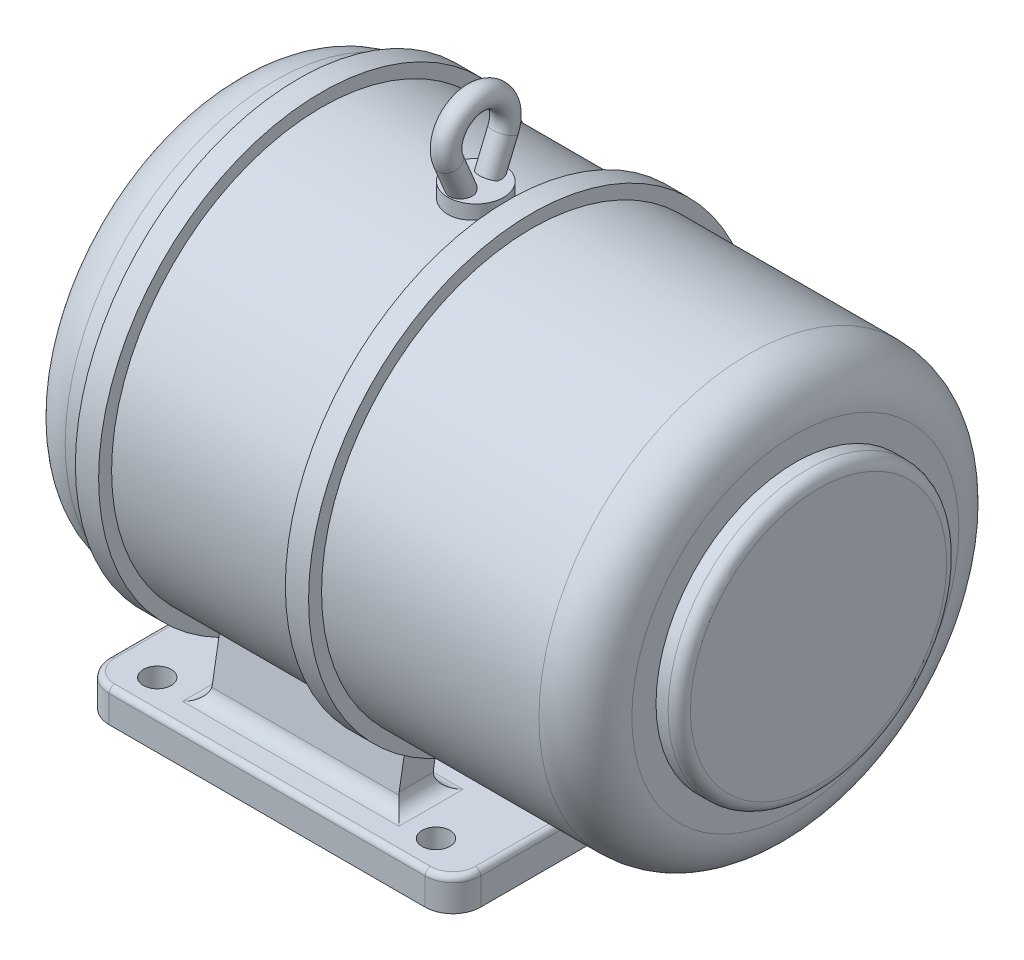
ISO-10303-21;
HEADER;
FILE_DESCRIPTION(('STEP AP214'),'2;1');
FILE_NAME('part.step','',(''),(''),'','','');
FILE_SCHEMA(('AUTOMOTIVE_DESIGN { 1 0 10303 214 1 1 1 1 }'));
ENDSEC;
DATA;
#1=APPLICATION_CONTEXT('core data for automotive mechanical design processes');
#2=APPLICATION_PROTOCOL_DEFINITION('international standard','automotive_design',2000,#1);
#3=PRODUCT_CONTEXT('',#1,'mechanical');
#4=PRODUCT('Part','Part','',(#3));
#5=PRODUCT_RELATED_PRODUCT_CATEGORY('part','',(#4));
#6=PRODUCT_DEFINITION_FORMATION('','',#4);
#7=PRODUCT_DEFINITION_CONTEXT('part definition',#1,'design');
#8=PRODUCT_DEFINITION('design','',#6,#7);
#9=PRODUCT_DEFINITION_SHAPE('','',#8);
#10=(LENGTH_UNIT() NAMED_UNIT(*) SI_UNIT(.MILLI.,.METRE.));
#11=(NAMED_UNIT(*) PLANE_ANGLE_UNIT() SI_UNIT($,.RADIAN.));
#12=(NAMED_UNIT(*) SI_UNIT($,.STERADIAN.) SOLID_ANGLE_UNIT());
#13=UNCERTAINTY_MEASURE_WITH_UNIT(LENGTH_MEASURE(1.E-05),#10,'distance_accuracy_value','');
#14=(GEOMETRIC_REPRESENTATION_CONTEXT(3) GLOBAL_UNCERTAINTY_ASSIGNED_CONTEXT((#13)) GLOBAL_UNIT_ASSIGNED_CONTEXT((#10,
#11,#12)) REPRESENTATION_CONTEXT('',''));
#15=CARTESIAN_POINT('',(0.,0.,0.));
#16=DIRECTION('',(0.,0.,1.));
#17=DIRECTION('',(1.,0.,0.));
#18=AXIS2_PLACEMENT_3D('',#15,#16,#17);
#19=CARTESIAN_POINT('',(24.3123015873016,120.,0.));
#20=DIRECTION('',(0.,-1.,0.));
#21=DIRECTION('',(0.,0.,-1.));
#22=AXIS2_PLACEMENT_3D('',#19,#20,#21);
#23=PLANE('',#22);
#24=CARTESIAN_POINT('',(39.3123015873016,120.,0.));
#25=DIRECTION('',(0.,-1.,0.));
#26=DIRECTION('',(0.,0.,-1.));
#27=AXIS2_PLACEMENT_3D('',#24,#25,#26);
#28=CIRCLE('',#27,15.);
#29=CARTESIAN_POINT('',(39.3123015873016,120.,-15.));
#30=VERTEX_POINT('',#29);
#31=EDGE_CURVE('E1494',#30,#30,#28,.T.);
#32=ORIENTED_EDGE('',*,*,#31,.F.);
#33=EDGE_LOOP('',(#32));
#34=FACE_BOUND('',#33,.T.);
#35=DIRECTION('',(1.,0.,0.));
#36=VECTOR('',#35,1.);
#37=CARTESIAN_POINT('',(24.3123015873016,120.,5.92359940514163));
#38=LINE('',#37,#36);
#39=CARTESIAN_POINT('',(33.5457757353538,120.,5.92359940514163));
#40=VERTEX_POINT('',#39);
#41=CARTESIAN_POINT('',(45.0788274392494,120.,5.92359940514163));
#42=VERTEX_POINT('',#41);
#43=EDGE_CURVE('E302',#40,#42,#38,.T.);
#44=ORIENTED_EDGE('',*,*,#43,.T.);
#45=CARTESIAN_POINT('',(39.3123015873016,120.,7.71965744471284));
#46=DIRECTION('',(0.,-1.,0.));
#47=DIRECTION('',(0.,0.,-1.));
#48=AXIS2_PLACEMENT_3D('',#45,#46,#47);
#49=ELLIPSE('',#48,6.50171743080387,6.);
#50=EDGE_CURVE('E306',#42,#40,#49,.T.);
#51=ORIENTED_EDGE('',*,*,#50,.T.);
#52=EDGE_LOOP('',(#44,#51));
#53=FACE_BOUND('',#52,.T.);
#54=CARTESIAN_POINT('',(39.3123015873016,120.,-7.71965744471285));
#55=DIRECTION('',(0.,-1.,0.));
#56=DIRECTION('',(0.,0.,1.));
#57=AXIS2_PLACEMENT_3D('',#54,#55,#56);
#58=ELLIPSE('',#57,6.50171743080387,6.);
#59=CARTESIAN_POINT('',(45.0788274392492,120.,-5.92359940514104));
#60=VERTEX_POINT('',#59);
#61=CARTESIAN_POINT('',(33.5457757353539,120.,-5.92359940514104));
#62=VERTEX_POINT('',#61);
#63=EDGE_CURVE('E11',#60,#62,#58,.F.);
#64=ORIENTED_EDGE('',*,*,#63,.F.);
#65=DIRECTION('',(1.,0.,0.));
#66=VECTOR('',#65,1.);
#67=CARTESIAN_POINT('',(24.3123015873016,120.,-5.92359940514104));
#68=LINE('',#67,#66);
#69=EDGE_CURVE('E39',#62,#60,#68,.T.);
#70=ORIENTED_EDGE('',*,*,#69,.F.);
#71=EDGE_LOOP('',(#64,#70));
#72=FACE_BOUND('',#71,.T.);
#73=ADVANCED_FACE('F31',(#34,#53,#72),#23,.F.);
#74=CARTESIAN_POINT('',(-177.533806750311,0.,0.));
#75=DIRECTION('',(-1.,0.,0.));
#76=DIRECTION('',(0.,0.,1.));
#77=AXIS2_PLACEMENT_3D('',#74,#75,#76);
#78=CYLINDRICAL_SURFACE('',#77,113.);
#79=CARTESIAN_POINT('',(-43.6876984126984,0.,0.));
#80=DIRECTION('',(-1.,0.,0.));
#81=DIRECTION('',(0.,0.,1.));
#82=AXIS2_PLACEMENT_3D('',#79,#80,#81);
#83=CIRCLE('',#82,113.);
#84=CARTESIAN_POINT('',(-43.6876984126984,-109.298742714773,-28.6842263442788));
#85=VERTEX_POINT('',#84);
#86=CARTESIAN_POINT('',(-43.6876984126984,-109.298742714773,28.6842263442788));
#87=VERTEX_POINT('',#86);
#88=EDGE_CURVE('E751',#85,#87,#83,.T.);
#89=ORIENTED_EDGE('',*,*,#88,.F.);
#90=DIRECTION('',(-1.,0.,0.));
#91=VECTOR('',#90,1.);
#92=CARTESIAN_POINT('',(-177.533806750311,-109.298742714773,-28.6842263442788));
#93=LINE('',#92,#91);
#94=CARTESIAN_POINT('',(56.81,-109.298742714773,-28.6842263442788));
#95=VERTEX_POINT('',#94);
#96=EDGE_CURVE('E535',#85,#95,#93,.F.);
#97=ORIENTED_EDGE('',*,*,#96,.T.);
#98=CARTESIAN_POINT('',(56.81,0.,0.));
#99=DIRECTION('',(-1.,0.,0.));
#100=DIRECTION('',(0.,0.,1.));
#101=AXIS2_PLACEMENT_3D('',#98,#99,#100);
#102=CIRCLE('',#101,113.);
#103=CARTESIAN_POINT('',(56.81,-96.5548817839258,-58.7039590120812));
#104=VERTEX_POINT('',#103);
#105=EDGE_CURVE('E435',#104,#95,#102,.T.);
#106=ORIENTED_EDGE('',*,*,#105,.F.);
#107=DIRECTION('',(-1.,0.,0.));
#108=VECTOR('',#107,1.);
#109=CARTESIAN_POINT('',(-177.533806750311,-96.5548817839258,-58.7039590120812));
#110=LINE('',#109,#108);
#111=CARTESIAN_POINT('',(-43.6876984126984,-96.5548817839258,-58.7039590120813));
#112=VERTEX_POINT('',#111);
#113=EDGE_CURVE('E528',#104,#112,#110,.T.);
#114=ORIENTED_EDGE('',*,*,#113,.T.);
#115=CARTESIAN_POINT('',(-43.6876984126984,-96.5548817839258,58.7039590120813));
#116=VERTEX_POINT('',#115);
#117=EDGE_CURVE('E748',#116,#112,#83,.T.);
#118=ORIENTED_EDGE('',*,*,#117,.F.);
#119=DIRECTION('',(-1.,0.,0.));
#120=VECTOR('',#119,1.);
#121=CARTESIAN_POINT('',(-177.533806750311,-96.5548817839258,58.7039590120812));
#122=LINE('',#121,#120);
#123=CARTESIAN_POINT('',(56.81,-96.5548817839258,58.7039590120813));
#124=VERTEX_POINT('',#123);
#125=EDGE_CURVE('E530',#116,#124,#122,.F.);
#126=ORIENTED_EDGE('',*,*,#125,.T.);
#127=CARTESIAN_POINT('',(56.81,0.,0.));
#128=DIRECTION('',(1.,0.,0.));
#129=DIRECTION('',(0.,0.,-1.));
#130=AXIS2_PLACEMENT_3D('',#127,#128,#129);
#131=CIRCLE('',#130,113.);
#132=CARTESIAN_POINT('',(56.81,-109.298742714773,28.6842263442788));
#133=VERTEX_POINT('',#132);
#134=EDGE_CURVE('E442',#124,#133,#131,.T.);
#135=ORIENTED_EDGE('',*,*,#134,.T.);
#136=DIRECTION('',(-1.,0.,0.));
#137=VECTOR('',#136,1.);
#138=CARTESIAN_POINT('',(-177.533806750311,-109.298742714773,28.6842263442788));
#139=LINE('',#138,#137);
#140=EDGE_CURVE('E533',#133,#87,#139,.T.);
#141=ORIENTED_EDGE('',*,*,#140,.T.);
#142=EDGE_LOOP('',(#89,#97,#106,#114,#118,#126,#135,#141));
#143=FACE_BOUND('',#142,.T.);
#144=CARTESIAN_POINT('',(56.8123015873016,0.,0.));
#145=DIRECTION('',(-1.,0.,0.));
#146=DIRECTION('',(0.,0.,1.));
#147=AXIS2_PLACEMENT_3D('',#144,#145,#146);
#148=CIRCLE('',#147,113.);
#149=CARTESIAN_POINT('',(56.8123015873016,0.,113.));
#150=VERTEX_POINT('',#149);
#151=EDGE_CURVE('E752',#150,#150,#148,.T.);
#152=ORIENTED_EDGE('',*,*,#151,.T.);
#153=EDGE_LOOP('',(#152));
#154=FACE_BOUND('',#153,.T.);
#155=CARTESIAN_POINT('',(39.3123015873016,112.,-15.));
#156=CARTESIAN_POINT('',(38.8928727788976,111.999998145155,-15.0000050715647));
#157=CARTESIAN_POINT('',(38.4735173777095,112.002360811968,-14.9824017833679));
#158=CARTESIAN_POINT('',(37.6376755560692,112.011739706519,-14.9121256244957));
#159=CARTESIAN_POINT('',(37.2211897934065,112.018756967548,-14.8594449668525));
#160=CARTESIAN_POINT('',(36.3938269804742,112.037253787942,-14.719331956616));
#161=CARTESIAN_POINT('',(35.982955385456,112.048737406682,-14.6318679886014));
#162=CARTESIAN_POINT('',(35.1701172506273,112.075834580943,-14.422843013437));
#163=CARTESIAN_POINT('',(34.7681507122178,112.091448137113,-14.3012820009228));
#164=CARTESIAN_POINT('',(33.9762487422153,112.126344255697,-14.025058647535));
#165=CARTESIAN_POINT('',(33.5863048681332,112.145624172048,-13.8704201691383));
#166=CARTESIAN_POINT('',(32.8208663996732,112.187310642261,-13.5291118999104));
#167=CARTESIAN_POINT('',(32.4453719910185,112.209717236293,-13.3424416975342));
#168=CARTESIAN_POINT('',(31.7115069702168,112.257017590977,-12.9384440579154));
#169=CARTESIAN_POINT('',(31.3531333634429,112.281910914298,-12.7211220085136));
#170=CARTESIAN_POINT('',(30.6559085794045,112.333486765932,-12.2573312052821));
#171=CARTESIAN_POINT('',(30.31705743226,112.360169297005,-12.0108624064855));
#172=CARTESIAN_POINT('',(29.6593560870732,112.414729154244,-11.4890318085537));
#173=CARTESIAN_POINT('',(29.3406292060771,112.442612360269,-11.2135151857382));
#174=CARTESIAN_POINT('',(28.727481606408,112.498645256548,-10.6366706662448));
#175=CARTESIAN_POINT('',(28.4330609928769,112.526794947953,-10.3353426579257));
#176=CARTESIAN_POINT('',(27.8705622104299,112.582569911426,-9.70895461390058));
#177=CARTESIAN_POINT('',(27.6024853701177,112.610195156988,-9.38389338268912));
#178=CARTESIAN_POINT('',(27.0945709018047,112.664143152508,-8.71230785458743));
#179=CARTESIAN_POINT('',(26.8547332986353,112.690465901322,-8.3657835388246));
#180=CARTESIAN_POINT('',(26.4041524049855,112.741163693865,-7.65234305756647));
#181=CARTESIAN_POINT('',(26.1935215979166,112.76553106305,-7.28535529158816));
#182=CARTESIAN_POINT('',(25.8039458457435,112.811516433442,-6.53476202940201));
#183=CARTESIAN_POINT('',(25.6250010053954,112.83313442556,-6.15115647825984));
#184=CARTESIAN_POINT('',(25.3001148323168,112.873005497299,-5.37005879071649));
#185=CARTESIAN_POINT('',(25.1541724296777,112.891258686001,-4.97256710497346));
#186=CARTESIAN_POINT('',(24.8963693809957,112.923880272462,-4.16652569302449));
#187=CARTESIAN_POINT('',(24.7845085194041,112.93824869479,-3.75797603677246));
#188=CARTESIAN_POINT('',(24.5962665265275,112.962617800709,-2.9351938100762));
#189=CARTESIAN_POINT('',(24.5196800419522,112.972643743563,-2.52100896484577));
#190=CARTESIAN_POINT('',(24.4015941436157,112.988166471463,-1.68758307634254));
#191=CARTESIAN_POINT('',(24.3600946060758,112.993663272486,-1.26834205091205));
#192=CARTESIAN_POINT('',(24.3124973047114,112.999971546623,-0.42783637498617));
#193=CARTESIAN_POINT('',(24.3063981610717,113.000783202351,-0.00657180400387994));
#194=CARTESIAN_POINT('',(24.3296443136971,112.997698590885,0.834960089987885));
#195=CARTESIAN_POINT('',(24.3589894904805,112.993802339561,1.25522741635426));
#196=CARTESIAN_POINT('',(24.4526051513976,112.981451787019,2.08910050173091));
#197=CARTESIAN_POINT('',(24.5166543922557,112.973026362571,2.50273155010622));
#198=CARTESIAN_POINT('',(24.6790546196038,112.951872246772,3.32308928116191));
#199=CARTESIAN_POINT('',(24.7774054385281,112.939143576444,3.72981599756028));
#200=CARTESIAN_POINT('',(25.0076853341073,112.909738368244,4.53350805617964));
#201=CARTESIAN_POINT('',(25.1396148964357,112.893061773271,4.93047325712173));
#202=CARTESIAN_POINT('',(25.4360904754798,112.856225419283,5.71186351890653));
#203=CARTESIAN_POINT('',(25.6006366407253,112.836065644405,6.09628852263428));
#204=CARTESIAN_POINT('',(25.9617048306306,112.79275788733,6.85106615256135));
#205=CARTESIAN_POINT('',(26.1583215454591,112.769601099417,7.22137297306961));
#206=CARTESIAN_POINT('',(26.5817749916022,112.720992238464,7.94412458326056));
#207=CARTESIAN_POINT('',(26.8086117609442,112.695540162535,8.29656935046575));
#208=CARTESIAN_POINT('',(27.2909190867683,112.643047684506,8.98118592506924));
#209=CARTESIAN_POINT('',(27.5463908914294,112.616007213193,9.31335684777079));
#210=CARTESIAN_POINT('',(28.0841823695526,112.561090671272,9.95513007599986));
#211=CARTESIAN_POINT('',(28.3665021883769,112.533214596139,10.2647322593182));
#212=CARTESIAN_POINT('',(28.9583167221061,112.477186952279,10.8615357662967));
#213=CARTESIAN_POINT('',(29.2680042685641,112.44903491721,11.1485458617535));
#214=CARTESIAN_POINT('',(29.9105047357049,112.393466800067,11.6954778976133));
#215=CARTESIAN_POINT('',(30.2433177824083,112.366050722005,11.9553996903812));
#216=CARTESIAN_POINT('',(30.929751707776,112.3127333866,12.4463209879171));
#217=CARTESIAN_POINT('',(31.2833727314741,112.286832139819,12.6773202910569));
#218=CARTESIAN_POINT('',(32.0089490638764,112.23728427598,13.1087446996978));
#219=CARTESIAN_POINT('',(32.3809043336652,112.213637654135,13.3091698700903));
#220=CARTESIAN_POINT('',(33.1407371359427,112.169266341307,13.6780936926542));
#221=CARTESIAN_POINT('',(33.528622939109,112.148543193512,13.8465754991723));
#222=CARTESIAN_POINT('',(34.3173859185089,112.110632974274,14.1502440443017));
#223=CARTESIAN_POINT('',(34.7182631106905,112.093445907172,14.2854307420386));
#224=CARTESIAN_POINT('',(35.5301263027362,112.063108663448,14.5214962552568));
#225=CARTESIAN_POINT('',(35.9411118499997,112.049958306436,14.6223766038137));
#226=CARTESIAN_POINT('',(36.7702484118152,112.028078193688,14.7890762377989));
#227=CARTESIAN_POINT('',(37.1883993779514,112.019348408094,14.8548957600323));
#228=CARTESIAN_POINT('',(38.0256390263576,112.006614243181,14.9506080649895));
#229=CARTESIAN_POINT('',(38.4446963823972,112.002574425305,14.9807703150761));
#230=CARTESIAN_POINT('',(39.2838823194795,111.999217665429,15.0058457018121));
#231=CARTESIAN_POINT('',(39.7040108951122,111.999900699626,15.0007590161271));
#232=CARTESIAN_POINT('',(40.5423173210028,112.005969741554,14.9553757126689));
#233=CARTESIAN_POINT('',(40.9604952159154,112.011355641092,14.9150799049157));
#234=CARTESIAN_POINT('',(41.7919173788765,112.026674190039,14.7995829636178));
#235=CARTESIAN_POINT('',(42.2051616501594,112.036606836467,14.7243818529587));
#236=CARTESIAN_POINT('',(43.0221959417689,112.060685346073,14.5399930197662));
#237=CARTESIAN_POINT('',(43.426016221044,112.074814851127,14.4309371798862));
#238=CARTESIAN_POINT('',(44.2230033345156,112.106897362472,14.1795488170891));
#239=CARTESIAN_POINT('',(44.6161702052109,112.124850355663,14.0372164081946));
#240=CARTESIAN_POINT('',(45.3891249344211,112.164070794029,13.720302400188));
#241=CARTESIAN_POINT('',(45.7689123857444,112.185338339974,13.5457198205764));
#242=CARTESIAN_POINT('',(46.5124734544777,112.230587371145,13.1655565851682));
#243=CARTESIAN_POINT('',(46.8762469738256,112.254568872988,12.9599757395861));
#244=CARTESIAN_POINT('',(47.5873895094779,112.304721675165,12.5179564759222));
#245=CARTESIAN_POINT('',(47.9346482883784,112.330905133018,12.2813420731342));
#246=CARTESIAN_POINT('',(48.6080346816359,112.384598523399,11.7798801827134));
#247=CARTESIAN_POINT('',(48.9341622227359,112.412108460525,11.5150325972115));
#248=CARTESIAN_POINT('',(49.563048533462,112.46768283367,10.958940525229));
#249=CARTESIAN_POINT('',(49.8658063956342,112.495747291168,10.6676950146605));
#250=CARTESIAN_POINT('',(50.4458471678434,112.551643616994,10.0608323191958));
#251=CARTESIAN_POINT('',(50.723129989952,112.579475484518,9.74521505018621));
#252=CARTESIAN_POINT('',(51.2519986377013,112.634305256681,9.08967195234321));
#253=CARTESIAN_POINT('',(51.5034066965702,112.661296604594,8.74960212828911));
#254=CARTESIAN_POINT('',(51.9766780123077,112.713491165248,8.04935729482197));
#255=CARTESIAN_POINT('',(52.1985411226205,112.738694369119,7.68918218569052));
#256=CARTESIAN_POINT('',(52.6111229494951,112.786597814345,6.95126131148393));
#257=CARTESIAN_POINT('',(52.8018421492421,112.80929809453,6.57351581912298));
#258=CARTESIAN_POINT('',(53.150749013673,112.85155125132,5.80311831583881));
#259=CARTESIAN_POINT('',(53.3089368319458,112.871104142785,5.41046637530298));
#260=CARTESIAN_POINT('',(53.5911888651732,112.906452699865,4.61424447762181));
#261=CARTESIAN_POINT('',(53.7153538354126,112.922259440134,4.21071073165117));
#262=CARTESIAN_POINT('',(53.9292606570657,112.949742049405,3.39448112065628));
#263=CARTESIAN_POINT('',(54.0190025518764,112.961417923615,2.98178526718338));
#264=CARTESIAN_POINT('',(54.1633842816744,112.980305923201,2.15021484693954));
#265=CARTESIAN_POINT('',(54.2180256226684,112.987518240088,1.7313405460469));
#266=CARTESIAN_POINT('',(54.2917972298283,112.997274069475,0.890423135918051));
#267=CARTESIAN_POINT('',(54.3109276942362,112.99981760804,0.468380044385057));
#268=CARTESIAN_POINT('',(54.3135226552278,113.000162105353,-0.372567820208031));
#269=CARTESIAN_POINT('',(54.2972603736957,112.997999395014,-0.791471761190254));
#270=CARTESIAN_POINT('',(54.2297490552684,112.989066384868,-1.62639924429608));
#271=CARTESIAN_POINT('',(54.178500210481,112.982296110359,-2.04242280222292));
#272=CARTESIAN_POINT('',(54.0413994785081,112.964338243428,-2.86862843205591));
#273=CARTESIAN_POINT('',(53.9555477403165,112.953150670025,-3.27881052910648));
#274=CARTESIAN_POINT('',(53.7498781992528,112.926671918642,-4.09043280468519));
#275=CARTESIAN_POINT('',(53.6300603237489,112.911380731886,-4.49187296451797));
#276=CARTESIAN_POINT('',(53.3574005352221,112.877130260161,-5.28300831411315));
#277=CARTESIAN_POINT('',(53.2045737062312,112.85817265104,-5.67270877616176));
#278=CARTESIAN_POINT('',(52.8669707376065,112.817113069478,-6.4378409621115));
#279=CARTESIAN_POINT('',(52.6821946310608,112.795011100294,-6.81327270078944));
#280=CARTESIAN_POINT('',(52.2820104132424,112.748276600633,-7.54727649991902));
#281=CARTESIAN_POINT('',(52.066602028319,112.723644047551,-7.90584840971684));
#282=CARTESIAN_POINT('',(51.6066712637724,112.672531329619,-8.6036677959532));
#283=CARTESIAN_POINT('',(51.3621487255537,112.646051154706,-8.94291516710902));
#284=CARTESIAN_POINT('',(50.8437857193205,112.591776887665,-9.60218728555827));
#285=CARTESIAN_POINT('',(50.5697423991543,112.563974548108,-9.92205187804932));
#286=CARTESIAN_POINT('',(49.9957525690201,112.508020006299,-10.5375978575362));
#287=CARTESIAN_POINT('',(49.6958058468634,112.479867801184,-10.833279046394));
#288=CARTESIAN_POINT('',(49.0720202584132,112.423999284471,-11.3984678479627));
#289=CARTESIAN_POINT('',(48.7481756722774,112.396283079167,-11.6679691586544));
#290=CARTESIAN_POINT('',(48.0789095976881,112.342076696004,-12.1788261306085));
#291=CARTESIAN_POINT('',(47.7334883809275,112.315586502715,-12.4201821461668));
#292=CARTESIAN_POINT('',(47.0219080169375,112.264471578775,-12.8740368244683));
#293=CARTESIAN_POINT('',(46.6556647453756,112.239855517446,-13.0864046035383));
#294=CARTESIAN_POINT('',(45.9064080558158,112.193326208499,-13.4794934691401));
#295=CARTESIAN_POINT('',(45.5233946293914,112.171412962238,-13.66021453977));
#296=CARTESIAN_POINT('',(44.7436710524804,112.130943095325,-13.9885298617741));
#297=CARTESIAN_POINT('',(44.3469743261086,112.112383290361,-14.1361555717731));
#298=CARTESIAN_POINT('',(43.5425102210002,112.079137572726,-14.3973681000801));
#299=CARTESIAN_POINT('',(43.1347454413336,112.064450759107,-14.5109628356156));
#300=CARTESIAN_POINT('',(42.1646094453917,112.034927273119,-14.7374580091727));
#301=CARTESIAN_POINT('',(41.5987230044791,112.021886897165,-14.8358073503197));
#302=CARTESIAN_POINT('',(40.4592791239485,112.004424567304,-14.9670745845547));
#303=CARTESIAN_POINT('',(39.8857217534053,112.000002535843,-14.9999930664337));
#304=CARTESIAN_POINT('',(39.3123015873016,112.,-15.));
#305=B_SPLINE_CURVE_WITH_KNOTS('',3,(#155,#156,#157,#158,#159,#160,#161,#162,#163,#164,#165,
#166,#167,#168,#169,#170,#171,#172,#173,#174,#175,#176,#177,#178,#179,#180,#181,#182,#183,#184,
#185,#186,#187,#188,#189,#190,#191,#192,#193,#194,#195,#196,#197,#198,#199,#200,#201,#202,#203,
#204,#205,#206,#207,#208,#209,#210,#211,#212,#213,#214,#215,#216,#217,#218,#219,#220,#221,#222,
#223,#224,#225,#226,#227,#228,#229,#230,#231,#232,#233,#234,#235,#236,#237,#238,#239,#240,#241,
#242,#243,#244,#245,#246,#247,#248,#249,#250,#251,#252,#253,#254,#255,#256,#257,#258,#259,#260,
#261,#262,#263,#264,#265,#266,#267,#268,#269,#270,#271,#272,#273,#274,#275,#276,#277,#278,#279,
#280,#281,#282,#283,#284,#285,#286,#287,#288,#289,#290,#291,#292,#293,#294,#295,#296,#297,#298,
#299,#300,#301,#302,#303,#304),.UNSPECIFIED.,.T.,.F.,(4,2,2,2,2,2,2,2,2,2,2,2,2,2,2,2,2,2,2,2,2,
2,2,2,2,2,2,2,2,2,2,2,2,2,2,2,2,2,2,2,2,2,2,2,2,2,2,2,2,2,2,2,2,2,2,2,2,2,2,2,2,2,2,2,2,2,2,2,2,
2,2,2,2,2,4),(0.,1.25778438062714,2.51584807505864,3.77505787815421,5.03426787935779,
6.29257251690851,7.55089332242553,8.80899322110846,10.0670950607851,11.3322784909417,
12.5974673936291,13.862720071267,15.1279738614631,16.3979726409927,17.6679756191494,
18.9379374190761,20.2078911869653,21.4703553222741,22.7328150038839,23.9952254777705,
25.257631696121,26.5120829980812,27.7665281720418,29.0209914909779,30.2754605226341,
31.5337028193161,32.7919466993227,34.0502454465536,35.3085510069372,36.5765633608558,
37.8445826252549,39.1126107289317,40.3806361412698,41.6493284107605,42.9180222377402,
44.1866593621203,45.4552879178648,46.7142666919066,47.9732391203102,49.2321825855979,
50.4911252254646,51.7452238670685,52.9993182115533,54.2534506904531,55.507590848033,
56.7691781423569,58.0307698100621,59.2924104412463,60.5540554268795,61.8238589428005,
63.0936687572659,64.3634588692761,65.633242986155,66.8992250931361,68.1652056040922,
69.4311317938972,70.6970509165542,71.9532321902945,73.2094065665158,74.4655755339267,
75.7217471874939,76.9773460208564,78.2329435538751,79.4885523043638,80.7441678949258,
82.0090403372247,83.2739231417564,84.5391096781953,85.8042802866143,87.0749865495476,
88.3456934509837,89.6151873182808,90.8843856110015,92.6039752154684,94.323549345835),.UNSPECIFIED.);
#306=CARTESIAN_POINT('',(39.3123015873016,112.,-15.));
#307=VERTEX_POINT('',#306);
#308=EDGE_CURVE('E307',#307,#307,#305,.T.);
#309=ORIENTED_EDGE('',*,*,#308,.F.);
#310=EDGE_LOOP('',(#309));
#311=FACE_BOUND('',#310,.T.);
#312=ADVANCED_FACE('F328',(#143,#154,#311),#78,.T.);
#313=CARTESIAN_POINT('',(56.81,-134.559193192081,-41.8633791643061));
#314=DIRECTION('',(-1.,0.,0.));
#315=DIRECTION('',(0.,0.,1.));
#316=AXIS2_PLACEMENT_3D('',#313,#314,#315);
#317=PLANE('',#316);
#318=DIRECTION('',(0.,-0.985379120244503,-0.170376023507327));
#319=VECTOR('',#318,1.);
#320=CARTESIAN_POINT('',(56.81,-100.76512110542,-36.0202478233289));
#321=LINE('',#320,#319);
#322=CARTESIAN_POINT('',(56.81,-115.673698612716,-38.5980009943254));
#323=VERTEX_POINT('',#322);
#324=CARTESIAN_POINT('',(56.81,-125.136991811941,-40.2342425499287));
#325=VERTEX_POINT('',#324);
#326=EDGE_CURVE('E720',#323,#325,#321,.T.);
#327=ORIENTED_EDGE('',*,*,#326,.T.);
#328=CARTESIAN_POINT('',(56.81,-126.5,-32.3512095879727));
#329=DIRECTION('',(-1.,0.,0.));
#330=DIRECTION('',(0.,0.,1.));
#331=AXIS2_PLACEMENT_3D('',#328,#329,#330);
#332=CIRCLE('',#331,8.);
#333=CARTESIAN_POINT('',(56.81,-126.5,-40.3512095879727));
#334=VERTEX_POINT('',#333);
#335=EDGE_CURVE('E552',#325,#334,#332,.T.);
#336=ORIENTED_EDGE('',*,*,#335,.T.);
#337=DIRECTION('',(0.,0.,1.));
#338=VECTOR('',#337,1.);
#339=CARTESIAN_POINT('',(56.81,-126.5,80.));
#340=LINE('',#339,#338);
#341=CARTESIAN_POINT('',(56.81,-126.5,-58.7369929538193));
#342=VERTEX_POINT('',#341);
#343=EDGE_CURVE('E500',#334,#342,#340,.F.);
#344=ORIENTED_EDGE('',*,*,#343,.T.);
#345=DIRECTION('',(0.,0.985379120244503,0.170376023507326));
#346=VECTOR('',#345,1.);
#347=CARTESIAN_POINT('',(56.81,-92.628204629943,-52.8804229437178));
#348=LINE('',#347,#346);
#349=CARTESIAN_POINT('',(56.81,-104.753633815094,-54.9769585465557));
#350=VERTEX_POINT('',#349);
#351=EDGE_CURVE('E723',#342,#350,#348,.T.);
#352=ORIENTED_EDGE('',*,*,#351,.T.);
#353=CARTESIAN_POINT('',(56.81,-103.390625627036,-62.8599915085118));
#354=DIRECTION('',(-1.,0.,0.));
#355=DIRECTION('',(0.,0.,1.));
#356=AXIS2_PLACEMENT_3D('',#353,#354,#355);
#357=CIRCLE('',#356,8.);
#358=EDGE_CURVE('E574',#350,#104,#357,.T.);
#359=ORIENTED_EDGE('',*,*,#358,.T.);
#360=ORIENTED_EDGE('',*,*,#105,.T.);
#361=CARTESIAN_POINT('',(56.81,-117.036706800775,-30.7149680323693));
#362=DIRECTION('',(-1.,0.,0.));
#363=DIRECTION('',(0.,0.,1.));
#364=AXIS2_PLACEMENT_3D('',#361,#362,#363);
#365=CIRCLE('',#364,8.);
#366=EDGE_CURVE('E565',#95,#323,#365,.T.);
#367=ORIENTED_EDGE('',*,*,#366,.T.);
#368=EDGE_LOOP('',(#327,#336,#344,#352,#359,#360,#367));
#369=FACE_BOUND('',#368,.T.);
#370=ADVANCED_FACE('F846',(#369),#317,.F.);
#371=CARTESIAN_POINT('',(56.81,-100.76512110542,-36.0202478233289));
#372=DIRECTION('',(0.,0.170376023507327,-0.985379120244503));
#373=DIRECTION('',(0.,0.985379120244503,0.170376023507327));
#374=AXIS2_PLACEMENT_3D('',#371,#372,#373);
#375=PLANE('',#374);
#376=DIRECTION('',(0.,-0.985379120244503,-0.170376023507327));
#377=VECTOR('',#376,1.);
#378=CARTESIAN_POINT('',(-43.69,-100.76512110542,-36.0202478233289));
#379=LINE('',#378,#377);
#380=CARTESIAN_POINT('',(-43.69,-115.673698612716,-38.5980009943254));
#381=VERTEX_POINT('',#380);
#382=CARTESIAN_POINT('',(-43.69,-125.136991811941,-40.2342425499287));
#383=VERTEX_POINT('',#382);
#384=EDGE_CURVE('E715',#381,#383,#379,.T.);
#385=ORIENTED_EDGE('',*,*,#384,.T.);
#386=DIRECTION('',(-1.,0.,0.));
#387=VECTOR('',#386,1.);
#388=CARTESIAN_POINT('',(-93.,-125.136991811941,-40.2342425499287));
#389=LINE('',#388,#387);
#390=EDGE_CURVE('E505',#383,#325,#389,.F.);
#391=ORIENTED_EDGE('',*,*,#390,.T.);
#392=ORIENTED_EDGE('',*,*,#326,.F.);
#393=DIRECTION('',(1.,0.,0.));
#394=VECTOR('',#393,1.);
#395=CARTESIAN_POINT('',(-177.533806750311,-115.673698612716,-38.5980009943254));
#396=LINE('',#395,#394);
#397=EDGE_CURVE('E502',#323,#381,#396,.F.);
#398=ORIENTED_EDGE('',*,*,#397,.T.);
#399=EDGE_LOOP('',(#385,#391,#392,#398));
#400=FACE_BOUND('',#399,.T.);
#401=ADVANCED_FACE('F853',(#400),#375,.F.);
#402=CARTESIAN_POINT('',(56.81,-92.628204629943,-52.8804229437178));
#403=DIRECTION('',(0.,-0.170376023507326,0.985379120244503));
#404=DIRECTION('',(0.,-0.985379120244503,-0.170376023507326));
#405=AXIS2_PLACEMENT_3D('',#402,#403,#404);
#406=PLANE('',#405);
#407=ORIENTED_EDGE('',*,*,#351,.F.);
#408=CARTESIAN_POINT('',(64.81,-126.5,-58.7369929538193));
#409=DIRECTION('',(0.,-0.170376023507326,0.985379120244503));
#410=DIRECTION('',(0.,-0.985379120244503,-0.170376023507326));
#411=AXIS2_PLACEMENT_3D('',#408,#409,#410);
#412=ELLIPSE('',#411,8.11870257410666,8.);
#413=CARTESIAN_POINT('',(56.926967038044,-127.863008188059,-58.9726625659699));
#414=VERTEX_POINT('',#413);
#415=EDGE_CURVE('E547',#342,#414,#412,.T.);
#416=ORIENTED_EDGE('',*,*,#415,.T.);
#417=DIRECTION('',(1.,0.,0.));
#418=VECTOR('',#417,1.);
#419=CARTESIAN_POINT('',(-93.,-127.863008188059,-58.9726625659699));
#420=LINE('',#419,#418);
#421=CARTESIAN_POINT('',(-43.806967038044,-127.863008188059,-58.9726625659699));
#422=VERTEX_POINT('',#421);
#423=EDGE_CURVE('E498',#414,#422,#420,.F.);
#424=ORIENTED_EDGE('',*,*,#423,.T.);
#425=CARTESIAN_POINT('',(-51.69,-126.5,-58.7369929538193));
#426=DIRECTION('',(0.,-0.170376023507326,0.985379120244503));
#427=DIRECTION('',(0.,0.985379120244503,0.170376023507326));
#428=AXIS2_PLACEMENT_3D('',#425,#426,#427);
#429=ELLIPSE('',#428,8.11870257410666,8.);
#430=CARTESIAN_POINT('',(-43.69,-126.5,-58.7369929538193));
#431=VERTEX_POINT('',#430);
#432=EDGE_CURVE('E545',#422,#431,#429,.T.);
#433=ORIENTED_EDGE('',*,*,#432,.T.);
#434=DIRECTION('',(0.,0.985379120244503,0.170376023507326));
#435=VECTOR('',#434,1.);
#436=CARTESIAN_POINT('',(-43.69,-92.628204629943,-52.8804229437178));
#437=LINE('',#436,#435);
#438=CARTESIAN_POINT('',(-43.69,-106.508580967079,-55.2803959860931));
#439=VERTEX_POINT('',#438);
#440=EDGE_CURVE('E718',#431,#439,#437,.T.);
#441=ORIENTED_EDGE('',*,*,#440,.T.);
#442=DIRECTION('',(-1.,0.,0.));
#443=VECTOR('',#442,1.);
#444=CARTESIAN_POINT('',(-177.533806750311,-106.508580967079,-55.2803959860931));
#445=LINE('',#444,#443);
#446=CARTESIAN_POINT('',(-43.6876984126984,-106.508580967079,-55.2803959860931));
#447=VERTEX_POINT('',#446);
#448=EDGE_CURVE('E427',#439,#447,#445,.F.);
#449=ORIENTED_EDGE('',*,*,#448,.T.);
#450=DIRECTION('',(0.,0.985379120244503,0.170376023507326));
#451=VECTOR('',#450,1.);
#452=CARTESIAN_POINT('',(-43.6876984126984,122.705659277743,-15.6483295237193));
#453=LINE('',#452,#451);
#454=CARTESIAN_POINT('',(-43.6876984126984,-104.753633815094,-54.9769585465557));
#455=VERTEX_POINT('',#454);
#456=EDGE_CURVE('E726',#447,#455,#453,.T.);
#457=ORIENTED_EDGE('',*,*,#456,.T.);
#458=DIRECTION('',(1.,0.,0.));
#459=VECTOR('',#458,1.);
#460=CARTESIAN_POINT('',(-177.533806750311,-104.753633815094,-54.9769585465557));
#461=LINE('',#460,#459);
#462=EDGE_CURVE('E495',#455,#350,#461,.T.);
#463=ORIENTED_EDGE('',*,*,#462,.T.);
#464=EDGE_LOOP('',(#407,#416,#424,#433,#441,#449,#457,#463));
#465=FACE_BOUND('',#464,.T.);
#466=ADVANCED_FACE('F883',(#465),#406,.F.);
#467=CARTESIAN_POINT('',(-43.69,-134.559193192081,-41.8633791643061));
#468=DIRECTION('',(-1.,0.,0.));
#469=DIRECTION('',(0.,0.,1.));
#470=AXIS2_PLACEMENT_3D('',#467,#468,#469);
#471=PLANE('',#470);
#472=ORIENTED_EDGE('',*,*,#440,.F.);
#473=DIRECTION('',(0.,0.,1.));
#474=VECTOR('',#473,1.);
#475=CARTESIAN_POINT('',(-43.69,-126.5,-41.8633791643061));
#476=LINE('',#475,#474);
#477=CARTESIAN_POINT('',(-43.69,-126.5,-40.3512095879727));
#478=VERTEX_POINT('',#477);
#479=EDGE_CURVE('E493',#431,#478,#476,.T.);
#480=ORIENTED_EDGE('',*,*,#479,.T.);
#481=CARTESIAN_POINT('',(-43.69,-126.5,-32.3512095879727));
#482=DIRECTION('',(-1.,0.,0.));
#483=DIRECTION('',(0.,0.,1.));
#484=AXIS2_PLACEMENT_3D('',#481,#482,#483);
#485=CIRCLE('',#484,8.);
#486=EDGE_CURVE('E550',#478,#383,#485,.F.);
#487=ORIENTED_EDGE('',*,*,#486,.T.);
#488=ORIENTED_EDGE('',*,*,#384,.F.);
#489=CARTESIAN_POINT('',(-43.69,-117.036706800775,-30.7149680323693));
#490=DIRECTION('',(-1.,0.,0.));
#491=DIRECTION('',(0.,0.,1.));
#492=AXIS2_PLACEMENT_3D('',#489,#490,#491);
#493=CIRCLE('',#492,8.);
#494=CARTESIAN_POINT('',(-43.69,-113.812275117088,-38.0363777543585));
#495=VERTEX_POINT('',#494);
#496=EDGE_CURVE('E562',#381,#495,#493,.F.);
#497=ORIENTED_EDGE('',*,*,#496,.T.);
#498=CARTESIAN_POINT('',(-43.69,0.,0.));
#499=DIRECTION('',(-1.,0.,0.));
#500=DIRECTION('',(0.,0.,1.));
#501=AXIS2_PLACEMENT_3D('',#498,#499,#500);
#502=CIRCLE('',#501,120.);
#503=EDGE_CURVE('E425',#439,#495,#502,.T.);
#504=ORIENTED_EDGE('',*,*,#503,.F.);
#505=EDGE_LOOP('',(#472,#480,#487,#488,#497,#504));
#506=FACE_BOUND('',#505,.T.);
#507=ADVANCED_FACE('F898',(#506),#471,.T.);
#508=CARTESIAN_POINT('',(56.81,-134.559193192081,60.1304599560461));
#509=DIRECTION('',(1.,0.,0.));
#510=DIRECTION('',(0.,0.,-1.));
#511=AXIS2_PLACEMENT_3D('',#508,#509,#510);
#512=PLANE('',#511);
#513=DIRECTION('',(0.,-0.985379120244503,0.170376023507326));
#514=VECTOR('',#513,1.);
#515=CARTESIAN_POINT('',(56.81,-92.628204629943,52.8804229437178));
#516=LINE('',#515,#514);
#517=CARTESIAN_POINT('',(56.81,-104.753633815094,54.9769585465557));
#518=VERTEX_POINT('',#517);
#519=CARTESIAN_POINT('',(56.81,-126.5,58.7369929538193));
#520=VERTEX_POINT('',#519);
#521=EDGE_CURVE('E707',#518,#520,#516,.T.);
#522=ORIENTED_EDGE('',*,*,#521,.T.);
#523=DIRECTION('',(0.,0.,-1.));
#524=VECTOR('',#523,1.);
#525=CARTESIAN_POINT('',(56.81,-126.5,60.1304599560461));
#526=LINE('',#525,#524);
#527=CARTESIAN_POINT('',(56.81,-126.5,40.3512095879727));
#528=VERTEX_POINT('',#527);
#529=EDGE_CURVE('E512',#520,#528,#526,.T.);
#530=ORIENTED_EDGE('',*,*,#529,.T.);
#531=CARTESIAN_POINT('',(56.81,-126.5,32.3512095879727));
#532=DIRECTION('',(1.,0.,0.));
#533=DIRECTION('',(0.,0.,-1.));
#534=AXIS2_PLACEMENT_3D('',#531,#532,#533);
#535=CIRCLE('',#534,8.);
#536=CARTESIAN_POINT('',(56.81,-125.136991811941,40.2342425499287));
#537=VERTEX_POINT('',#536);
#538=EDGE_CURVE('E555',#528,#537,#535,.F.);
#539=ORIENTED_EDGE('',*,*,#538,.T.);
#540=DIRECTION('',(0.,0.985379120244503,-0.170376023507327));
#541=VECTOR('',#540,1.);
#542=CARTESIAN_POINT('',(56.81,-100.76512110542,36.0202478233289));
#543=LINE('',#542,#541);
#544=CARTESIAN_POINT('',(56.81,-115.673698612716,38.5980009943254));
#545=VERTEX_POINT('',#544);
#546=EDGE_CURVE('E710',#537,#545,#543,.T.);
#547=ORIENTED_EDGE('',*,*,#546,.T.);
#548=CARTESIAN_POINT('',(56.81,-117.036706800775,30.7149680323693));
#549=DIRECTION('',(1.,0.,0.));
#550=DIRECTION('',(0.,0.,-1.));
#551=AXIS2_PLACEMENT_3D('',#548,#549,#550);
#552=CIRCLE('',#551,8.);
#553=EDGE_CURVE('E567',#545,#133,#552,.F.);
#554=ORIENTED_EDGE('',*,*,#553,.T.);
#555=ORIENTED_EDGE('',*,*,#134,.F.);
#556=CARTESIAN_POINT('',(56.81,-103.390625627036,62.8599915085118));
#557=DIRECTION('',(1.,0.,0.));
#558=DIRECTION('',(0.,0.,-1.));
#559=AXIS2_PLACEMENT_3D('',#556,#557,#558);
#560=CIRCLE('',#559,8.);
#561=EDGE_CURVE('E572',#124,#518,#560,.F.);
#562=ORIENTED_EDGE('',*,*,#561,.T.);
#563=EDGE_LOOP('',(#522,#530,#539,#547,#554,#555,#562));
#564=FACE_BOUND('',#563,.T.);
#565=ADVANCED_FACE('F935',(#564),#512,.T.);
#566=CARTESIAN_POINT('',(56.81,-92.628204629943,52.8804229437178));
#567=DIRECTION('',(0.,-0.170376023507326,-0.985379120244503));
#568=DIRECTION('',(0.,0.985379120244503,-0.170376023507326));
#569=AXIS2_PLACEMENT_3D('',#566,#567,#568);
#570=PLANE('',#569);
#571=CARTESIAN_POINT('',(-51.69,-126.5,58.7369929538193));
#572=DIRECTION('',(0.,-0.170376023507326,-0.985379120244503));
#573=DIRECTION('',(0.,-0.985379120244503,0.170376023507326));
#574=AXIS2_PLACEMENT_3D('',#571,#572,#573);
#575=ELLIPSE('',#574,8.11870257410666,8.);
#576=CARTESIAN_POINT('',(-43.69,-126.5,58.7369929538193));
#577=VERTEX_POINT('',#576);
#578=CARTESIAN_POINT('',(-43.806967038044,-127.863008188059,58.9726625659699));
#579=VERTEX_POINT('',#578);
#580=EDGE_CURVE('E542',#577,#579,#575,.T.);
#581=ORIENTED_EDGE('',*,*,#580,.T.);
#582=DIRECTION('',(-1.,0.,0.));
#583=VECTOR('',#582,1.);
#584=CARTESIAN_POINT('',(-93.,-127.863008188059,58.9726625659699));
#585=LINE('',#584,#583);
#586=CARTESIAN_POINT('',(56.926967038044,-127.863008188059,58.9726625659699));
#587=VERTEX_POINT('',#586);
#588=EDGE_CURVE('E517',#579,#587,#585,.F.);
#589=ORIENTED_EDGE('',*,*,#588,.T.);
#590=CARTESIAN_POINT('',(64.81,-126.5,58.7369929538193));
#591=DIRECTION('',(0.,-0.170376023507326,-0.985379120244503));
#592=DIRECTION('',(0.,0.985379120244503,-0.170376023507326));
#593=AXIS2_PLACEMENT_3D('',#590,#591,#592);
#594=ELLIPSE('',#593,8.11870257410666,8.);
#595=EDGE_CURVE('E560',#587,#520,#594,.T.);
#596=ORIENTED_EDGE('',*,*,#595,.T.);
#597=ORIENTED_EDGE('',*,*,#521,.F.);
#598=DIRECTION('',(1.,0.,0.));
#599=VECTOR('',#598,1.);
#600=CARTESIAN_POINT('',(-177.533806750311,-104.753633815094,54.9769585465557));
#601=LINE('',#600,#599);
#602=CARTESIAN_POINT('',(-43.6876984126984,-104.753633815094,54.9769585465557));
#603=VERTEX_POINT('',#602);
#604=EDGE_CURVE('E514',#518,#603,#601,.F.);
#605=ORIENTED_EDGE('',*,*,#604,.T.);
#606=DIRECTION('',(0.,-0.985379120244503,0.170376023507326));
#607=VECTOR('',#606,1.);
#608=CARTESIAN_POINT('',(-43.6876984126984,122.705659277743,15.6483295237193));
#609=LINE('',#608,#607);
#610=CARTESIAN_POINT('',(-43.6876984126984,-106.508580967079,55.2803959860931));
#611=VERTEX_POINT('',#610);
#612=EDGE_CURVE('E713',#603,#611,#609,.T.);
#613=ORIENTED_EDGE('',*,*,#612,.T.);
#614=DIRECTION('',(-1.,0.,0.));
#615=VECTOR('',#614,1.);
#616=CARTESIAN_POINT('',(-177.533806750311,-106.508580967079,55.2803959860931));
#617=LINE('',#616,#615);
#618=CARTESIAN_POINT('',(-43.69,-106.508580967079,55.2803959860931));
#619=VERTEX_POINT('',#618);
#620=EDGE_CURVE('E439',#611,#619,#617,.T.);
#621=ORIENTED_EDGE('',*,*,#620,.T.);
#622=DIRECTION('',(0.,-0.985379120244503,0.170376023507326));
#623=VECTOR('',#622,1.);
#624=CARTESIAN_POINT('',(-43.69,-92.628204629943,52.8804229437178));
#625=LINE('',#624,#623);
#626=EDGE_CURVE('E701',#619,#577,#625,.T.);
#627=ORIENTED_EDGE('',*,*,#626,.T.);
#628=EDGE_LOOP('',(#581,#589,#596,#597,#605,#613,#621,#627));
#629=FACE_BOUND('',#628,.T.);
#630=ADVANCED_FACE('F932',(#629),#570,.F.);
#631=CARTESIAN_POINT('',(56.81,-100.76512110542,36.0202478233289));
#632=DIRECTION('',(0.,0.170376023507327,0.985379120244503));
#633=DIRECTION('',(0.,-0.985379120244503,0.170376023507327));
#634=AXIS2_PLACEMENT_3D('',#631,#632,#633);
#635=PLANE('',#634);
#636=ORIENTED_EDGE('',*,*,#546,.F.);
#637=DIRECTION('',(1.,0.,0.));
#638=VECTOR('',#637,1.);
#639=CARTESIAN_POINT('',(-93.,-125.136991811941,40.2342425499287));
#640=LINE('',#639,#638);
#641=CARTESIAN_POINT('',(-43.69,-125.136991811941,40.2342425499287));
#642=VERTEX_POINT('',#641);
#643=EDGE_CURVE('E510',#537,#642,#640,.F.);
#644=ORIENTED_EDGE('',*,*,#643,.T.);
#645=DIRECTION('',(0.,0.985379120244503,-0.170376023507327));
#646=VECTOR('',#645,1.);
#647=CARTESIAN_POINT('',(-43.69,-100.76512110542,36.0202478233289));
#648=LINE('',#647,#646);
#649=CARTESIAN_POINT('',(-43.69,-115.673698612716,38.5980009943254));
#650=VERTEX_POINT('',#649);
#651=EDGE_CURVE('E704',#642,#650,#648,.T.);
#652=ORIENTED_EDGE('',*,*,#651,.T.);
#653=DIRECTION('',(1.,0.,0.));
#654=VECTOR('',#653,1.);
#655=CARTESIAN_POINT('',(-177.533806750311,-115.673698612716,38.5980009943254));
#656=LINE('',#655,#654);
#657=EDGE_CURVE('E507',#650,#545,#656,.T.);
#658=ORIENTED_EDGE('',*,*,#657,.T.);
#659=EDGE_LOOP('',(#636,#644,#652,#658));
#660=FACE_BOUND('',#659,.T.);
#661=ADVANCED_FACE('F965',(#660),#635,.F.);
#662=CARTESIAN_POINT('',(-43.69,-134.559193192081,60.1304599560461));
#663=DIRECTION('',(1.,0.,0.));
#664=DIRECTION('',(0.,0.,-1.));
#665=AXIS2_PLACEMENT_3D('',#662,#663,#664);
#666=PLANE('',#665);
#667=ORIENTED_EDGE('',*,*,#651,.F.);
#668=CARTESIAN_POINT('',(-43.69,-126.5,32.3512095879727));
#669=DIRECTION('',(1.,0.,0.));
#670=DIRECTION('',(0.,0.,-1.));
#671=AXIS2_PLACEMENT_3D('',#668,#669,#670);
#672=CIRCLE('',#671,8.);
#673=CARTESIAN_POINT('',(-43.69,-126.5,40.3512095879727));
#674=VERTEX_POINT('',#673);
#675=EDGE_CURVE('E557',#642,#674,#672,.T.);
#676=ORIENTED_EDGE('',*,*,#675,.T.);
#677=DIRECTION('',(0.,0.,-1.));
#678=VECTOR('',#677,1.);
#679=CARTESIAN_POINT('',(-43.69,-126.5,80.));
#680=LINE('',#679,#678);
#681=EDGE_CURVE('E490',#674,#577,#680,.F.);
#682=ORIENTED_EDGE('',*,*,#681,.T.);
#683=ORIENTED_EDGE('',*,*,#626,.F.);
#684=CARTESIAN_POINT('',(-43.69,0.,0.));
#685=DIRECTION('',(1.,0.,0.));
#686=DIRECTION('',(0.,0.,-1.));
#687=AXIS2_PLACEMENT_3D('',#684,#685,#686);
#688=CIRCLE('',#687,120.);
#689=CARTESIAN_POINT('',(-43.69,-113.812275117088,38.0363777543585));
#690=VERTEX_POINT('',#689);
#691=EDGE_CURVE('E437',#619,#690,#688,.T.);
#692=ORIENTED_EDGE('',*,*,#691,.T.);
#693=CARTESIAN_POINT('',(-43.69,-117.036706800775,30.7149680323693));
#694=DIRECTION('',(1.,0.,0.));
#695=DIRECTION('',(0.,0.,-1.));
#696=AXIS2_PLACEMENT_3D('',#693,#694,#695);
#697=CIRCLE('',#696,8.);
#698=EDGE_CURVE('E570',#690,#650,#697,.T.);
#699=ORIENTED_EDGE('',*,*,#698,.T.);
#700=EDGE_LOOP('',(#667,#676,#682,#683,#692,#699));
#701=FACE_BOUND('',#700,.T.);
#702=ADVANCED_FACE('F962',(#701),#666,.F.);
#703=CARTESIAN_POINT('',(-43.6876984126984,120.,0.));
#704=DIRECTION('',(-1.,0.,0.));
#705=DIRECTION('',(0.,0.,1.));
#706=AXIS2_PLACEMENT_3D('',#703,#704,#705);
#707=PLANE('',#706);
#708=ORIENTED_EDGE('',*,*,#612,.F.);
#709=CARTESIAN_POINT('',(-43.6876984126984,-103.390625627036,62.8599915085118));
#710=DIRECTION('',(-1.,0.,0.));
#711=DIRECTION('',(0.,0.,1.));
#712=AXIS2_PLACEMENT_3D('',#709,#710,#711);
#713=CIRCLE('',#712,8.);
#714=EDGE_CURVE('E540',#603,#116,#713,.F.);
#715=ORIENTED_EDGE('',*,*,#714,.T.);
#716=ORIENTED_EDGE('',*,*,#117,.T.);
#717=CARTESIAN_POINT('',(-43.6876984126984,-103.390625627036,-62.8599915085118));
#718=DIRECTION('',(-1.,0.,0.));
#719=DIRECTION('',(0.,0.,1.));
#720=AXIS2_PLACEMENT_3D('',#717,#718,#719);
#721=CIRCLE('',#720,8.);
#722=EDGE_CURVE('E538',#112,#455,#721,.F.);
#723=ORIENTED_EDGE('',*,*,#722,.T.);
#724=ORIENTED_EDGE('',*,*,#456,.F.);
#725=CARTESIAN_POINT('',(-43.6876984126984,0.,0.));
#726=DIRECTION('',(-1.,0.,0.));
#727=DIRECTION('',(0.,0.,1.));
#728=AXIS2_PLACEMENT_3D('',#725,#726,#727);
#729=CIRCLE('',#728,120.);
#730=EDGE_CURVE('E744',#611,#447,#729,.T.);
#731=ORIENTED_EDGE('',*,*,#730,.F.);
#732=EDGE_LOOP('',(#708,#715,#716,#723,#724,#731));
#733=FACE_BOUND('',#732,.T.);
#734=ADVANCED_FACE('F944',(#733),#707,.F.);
#735=CARTESIAN_POINT('',(-43.6876984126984,-113.812275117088,-38.0363777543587));
#736=VERTEX_POINT('',#735);
#737=CARTESIAN_POINT('',(-43.6876984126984,-113.812275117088,38.0363777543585));
#738=VERTEX_POINT('',#737);
#739=EDGE_CURVE('E745',#736,#738,#729,.T.);
#740=ORIENTED_EDGE('',*,*,#739,.F.);
#741=CARTESIAN_POINT('',(-43.6876984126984,-117.036706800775,-30.7149680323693));
#742=DIRECTION('',(-1.,0.,0.));
#743=DIRECTION('',(0.,0.,1.));
#744=AXIS2_PLACEMENT_3D('',#741,#742,#743);
#745=CIRCLE('',#744,8.);
#746=EDGE_CURVE('E526',#736,#85,#745,.F.);
#747=ORIENTED_EDGE('',*,*,#746,.T.);
#748=ORIENTED_EDGE('',*,*,#88,.T.);
#749=CARTESIAN_POINT('',(-43.6876984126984,-117.036706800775,30.7149680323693));
#750=DIRECTION('',(-1.,0.,0.));
#751=DIRECTION('',(0.,0.,1.));
#752=AXIS2_PLACEMENT_3D('',#749,#750,#751);
#753=CIRCLE('',#752,8.);
#754=EDGE_CURVE('E524',#87,#738,#753,.F.);
#755=ORIENTED_EDGE('',*,*,#754,.T.);
#756=EDGE_LOOP('',(#740,#747,#748,#755));
#757=FACE_BOUND('',#756,.T.);
#758=ADVANCED_FACE('F959',(#757),#707,.F.);
#759=CARTESIAN_POINT('',(-177.533806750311,0.,0.));
#760=DIRECTION('',(-1.,0.,0.));
#761=DIRECTION('',(0.,0.,1.));
#762=AXIS2_PLACEMENT_3D('',#759,#760,#761);
#763=CYLINDRICAL_SURFACE('',#762,120.);
#764=CARTESIAN_POINT('',(-56.1876984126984,0.,0.));
#765=DIRECTION('',(-1.,0.,0.));
#766=DIRECTION('',(0.,0.,1.));
#767=AXIS2_PLACEMENT_3D('',#764,#765,#766);
#768=CIRCLE('',#767,120.);
#769=CARTESIAN_POINT('',(-56.1876984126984,0.,120.));
#770=VERTEX_POINT('',#769);
#771=EDGE_CURVE('E741',#770,#770,#768,.T.);
#772=ORIENTED_EDGE('',*,*,#771,.F.);
#773=EDGE_LOOP('',(#772));
#774=FACE_BOUND('',#773,.T.);
#775=ORIENTED_EDGE('',*,*,#503,.T.);
#776=DIRECTION('',(-1.,0.,0.));
#777=VECTOR('',#776,1.);
#778=CARTESIAN_POINT('',(-43.69,-113.812275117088,-38.0363777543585));
#779=LINE('',#778,#777);
#780=EDGE_CURVE('E522',#495,#736,#779,.F.);
#781=ORIENTED_EDGE('',*,*,#780,.T.);
#782=ORIENTED_EDGE('',*,*,#739,.T.);
#783=DIRECTION('',(-1.,0.,0.));
#784=VECTOR('',#783,1.);
#785=CARTESIAN_POINT('',(-43.6876984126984,-113.812275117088,38.0363777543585));
#786=LINE('',#785,#784);
#787=EDGE_CURVE('E519',#738,#690,#786,.T.);
#788=ORIENTED_EDGE('',*,*,#787,.T.);
#789=ORIENTED_EDGE('',*,*,#691,.F.);
#790=ORIENTED_EDGE('',*,*,#620,.F.);
#791=ORIENTED_EDGE('',*,*,#730,.T.);
#792=ORIENTED_EDGE('',*,*,#448,.F.);
#793=EDGE_LOOP('',(#775,#781,#782,#788,#789,#790,#791,#792));
#794=FACE_BOUND('',#793,.T.);
#795=ADVANCED_FACE('F416',(#774,#794),#763,.T.);
#796=CARTESIAN_POINT('',(-177.533806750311,0.,0.));
#797=DIRECTION('',(-1.,0.,0.));
#798=DIRECTION('',(0.,0.,1.));
#799=AXIS2_PLACEMENT_3D('',#796,#797,#798);
#800=CYLINDRICAL_SURFACE('',#799,37.5);
#801=CARTESIAN_POINT('',(-97.1876984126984,0.,0.));
#802=DIRECTION('',(-1.,0.,0.));
#803=DIRECTION('',(0.,0.,1.));
#804=AXIS2_PLACEMENT_3D('',#801,#802,#803);
#805=CIRCLE('',#804,37.5);
#806=CARTESIAN_POINT('',(-97.1876984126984,0.,37.5));
#807=VERTEX_POINT('',#806);
#808=EDGE_CURVE('E424',#807,#807,#805,.T.);
#809=ORIENTED_EDGE('',*,*,#808,.F.);
#810=EDGE_LOOP('',(#809));
#811=FACE_BOUND('',#810,.T.);
#812=CARTESIAN_POINT('',(-93.6876984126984,0.,0.));
#813=DIRECTION('',(-1.,0.,0.));
#814=DIRECTION('',(0.,0.,1.));
#815=AXIS2_PLACEMENT_3D('',#812,#813,#814);
#816=CIRCLE('',#815,37.5);
#817=CARTESIAN_POINT('',(-93.6876984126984,0.,37.5));
#818=VERTEX_POINT('',#817);
#819=EDGE_CURVE('E729',#818,#818,#816,.T.);
#820=ORIENTED_EDGE('',*,*,#819,.T.);
#821=EDGE_LOOP('',(#820));
#822=FACE_BOUND('',#821,.T.);
#823=ADVANCED_FACE('F33',(#811,#822),#800,.T.);
#824=CARTESIAN_POINT('',(-97.1876984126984,0.,0.));
#825=DIRECTION('',(-1.,0.,0.));
#826=DIRECTION('',(0.,0.,1.));
#827=AXIS2_PLACEMENT_3D('',#824,#825,#826);
#828=TOROIDAL_SURFACE('',#827,33.5,4.);
#829=CARTESIAN_POINT('',(-101.187698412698,0.,0.));
#830=DIRECTION('',(-1.,0.,0.));
#831=DIRECTION('',(0.,0.,1.));
#832=AXIS2_PLACEMENT_3D('',#829,#830,#831);
#833=CIRCLE('',#832,33.5);
#834=CARTESIAN_POINT('',(-101.187698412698,0.,33.5));
#835=VERTEX_POINT('',#834);
#836=EDGE_CURVE('E421',#835,#835,#833,.T.);
#837=ORIENTED_EDGE('',*,*,#836,.F.);
#838=EDGE_LOOP('',(#837));
#839=FACE_BOUND('',#838,.T.);
#840=ORIENTED_EDGE('',*,*,#808,.T.);
#841=EDGE_LOOP('',(#840));
#842=FACE_BOUND('',#841,.T.);
#843=ADVANCED_FACE('F409',(#839,#842),#828,.T.);
#844=CARTESIAN_POINT('',(-101.187698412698,33.5,0.));
#845=DIRECTION('',(1.,0.,0.));
#846=DIRECTION('',(0.,0.,-1.));
#847=AXIS2_PLACEMENT_3D('',#844,#845,#846);
#848=PLANE('',#847);
#849=CARTESIAN_POINT('',(-101.187698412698,0.,0.));
#850=DIRECTION('',(-1.,0.,0.));
#851=DIRECTION('',(0.,0.,1.));
#852=AXIS2_PLACEMENT_3D('',#849,#850,#851);
#853=CIRCLE('',#852,16.);
#854=CARTESIAN_POINT('',(-101.187698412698,0.,16.));
#855=VERTEX_POINT('',#854);
#856=EDGE_CURVE('E429',#855,#855,#853,.T.);
#857=ORIENTED_EDGE('',*,*,#856,.F.);
#858=EDGE_LOOP('',(#857));
#859=FACE_BOUND('',#858,.T.);
#860=ORIENTED_EDGE('',*,*,#836,.T.);
#861=EDGE_LOOP('',(#860));
#862=FACE_BOUND('',#861,.T.);
#863=ADVANCED_FACE('F405',(#859,#862),#848,.F.);
#864=CARTESIAN_POINT('',(-177.533806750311,0.,0.));
#865=DIRECTION('',(-1.,0.,0.));
#866=DIRECTION('',(0.,0.,1.));
#867=AXIS2_PLACEMENT_3D('',#864,#865,#866);
#868=CYLINDRICAL_SURFACE('',#867,16.);
#869=DIRECTION('',(-1.,0.,0.));
#870=VECTOR('',#869,1.);
#871=CARTESIAN_POINT('',(-177.533806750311,15.1986841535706,5.));
#872=LINE('',#871,#870);
#873=CARTESIAN_POINT('',(-121.19,15.1986841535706,5.));
#874=VERTEX_POINT('',#873);
#875=CARTESIAN_POINT('',(-134.187698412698,15.1986841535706,5.));
#876=VERTEX_POINT('',#875);
#877=EDGE_CURVE('E642',#874,#876,#872,.T.);
#878=ORIENTED_EDGE('',*,*,#877,.T.);
#879=CARTESIAN_POINT('',(-134.187698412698,0.,0.));
#880=DIRECTION('',(1.,0.,0.));
#881=DIRECTION('',(0.,0.,-1.));
#882=AXIS2_PLACEMENT_3D('',#879,#880,#881);
#883=CIRCLE('',#882,16.);
#884=CARTESIAN_POINT('',(-134.187698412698,15.1986841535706,-4.99999999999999));
#885=VERTEX_POINT('',#884);
#886=EDGE_CURVE('E372',#876,#885,#883,.T.);
#887=ORIENTED_EDGE('',*,*,#886,.T.);
#888=DIRECTION('',(-1.,0.,0.));
#889=VECTOR('',#888,1.);
#890=CARTESIAN_POINT('',(-177.533806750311,15.1986841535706,-4.99999999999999));
#891=LINE('',#890,#889);
#892=CARTESIAN_POINT('',(-121.19,15.1986841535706,-5.));
#893=VERTEX_POINT('',#892);
#894=EDGE_CURVE('E639',#885,#893,#891,.F.);
#895=ORIENTED_EDGE('',*,*,#894,.T.);
#896=CARTESIAN_POINT('',(-121.19,15.1986841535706,5.));
#897=CARTESIAN_POINT('',(-121.463388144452,15.1986858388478,4.99999815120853));
#898=CARTESIAN_POINT('',(-121.736795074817,15.2061412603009,4.97750155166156));
#899=CARTESIAN_POINT('',(-122.275576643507,15.2350255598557,4.8883670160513));
#900=CARTESIAN_POINT('',(-122.540949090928,15.2564582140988,4.82171715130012));
#901=CARTESIAN_POINT('',(-123.055779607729,15.3106375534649,4.64679152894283));
#902=CARTESIAN_POINT('',(-123.305264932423,15.3433642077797,4.5385894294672));
#903=CARTESIAN_POINT('',(-123.782610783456,15.4164162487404,4.28387656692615));
#904=CARTESIAN_POINT('',(-124.01046747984,15.4567429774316,4.13735903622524));
#905=CARTESIAN_POINT('',(-124.445915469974,15.5420051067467,3.80478428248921));
#906=CARTESIAN_POINT('',(-124.652654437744,15.5870449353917,3.61763759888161));
#907=CARTESIAN_POINT('',(-125.032384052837,15.6757698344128,3.21144818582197));
#908=CARTESIAN_POINT('',(-125.205369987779,15.7194547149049,2.99240101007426));
#909=CARTESIAN_POINT('',(-125.516444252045,15.8017421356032,2.52250364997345));
#910=CARTESIAN_POINT('',(-125.653654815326,15.8402073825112,2.27104622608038));
#911=CARTESIAN_POINT('',(-125.883504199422,15.9065020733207,1.74721693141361));
#912=CARTESIAN_POINT('',(-125.976153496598,15.9343340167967,1.4748499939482));
#913=CARTESIAN_POINT('',(-126.111404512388,15.9754870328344,0.925857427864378));
#914=CARTESIAN_POINT('',(-126.155462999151,15.9892295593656,0.649622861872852));
#915=CARTESIAN_POINT('',(-126.19689738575,16.0021438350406,0.0933632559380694));
#916=CARTESIAN_POINT('',(-126.194283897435,16.0013188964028,-0.186660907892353));
#917=CARTESIAN_POINT('',(-126.143406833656,15.9854846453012,-0.732297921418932));
#918=CARTESIAN_POINT('',(-126.096722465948,15.9709660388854,-0.998074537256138));
#919=CARTESIAN_POINT('',(-125.961620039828,15.929979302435,-1.51781225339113));
#920=CARTESIAN_POINT('',(-125.873199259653,15.9035103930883,-1.77177258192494));
#921=CARTESIAN_POINT('',(-125.656119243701,15.8409383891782,-2.26431241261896));
#922=CARTESIAN_POINT('',(-125.526980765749,15.8047213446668,-2.50266562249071));
#923=CARTESIAN_POINT('',(-125.232515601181,15.7264689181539,-2.95481004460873));
#924=CARTESIAN_POINT('',(-125.067179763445,15.6844320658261,-3.16859502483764));
#925=CARTESIAN_POINT('',(-124.696905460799,15.5969468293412,-3.57495079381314));
#926=CARTESIAN_POINT('',(-124.490603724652,15.5514292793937,-3.76626619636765));
#927=CARTESIAN_POINT('',(-124.048419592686,15.4636246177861,-4.11195897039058));
#928=CARTESIAN_POINT('',(-123.812533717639,15.4213378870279,-4.26633199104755));
#929=CARTESIAN_POINT('',(-123.31433012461,15.3444338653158,-4.53521860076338));
#930=CARTESIAN_POINT('',(-123.051746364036,15.3099076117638,-4.64926722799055));
#931=CARTESIAN_POINT('',(-122.509762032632,15.2535018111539,-4.83113383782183));
#932=CARTESIAN_POINT('',(-122.230367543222,15.2316177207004,-4.89896843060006));
#933=CARTESIAN_POINT('',(-121.674720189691,15.2039825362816,-4.9840594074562));
#934=CARTESIAN_POINT('',(-121.398792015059,15.1976186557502,-5.00323817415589));
#935=CARTESIAN_POINT('',(-120.847641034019,15.2000430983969,-4.99586977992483));
#936=CARTESIAN_POINT('',(-120.572418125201,15.2088290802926,-4.96932968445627));
#937=CARTESIAN_POINT('',(-120.03876681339,15.2399582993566,-4.87299494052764));
#938=CARTESIAN_POINT('',(-119.780082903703,15.2619021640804,-4.80447324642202));
#939=CARTESIAN_POINT('',(-119.277912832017,15.3164514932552,-4.62761494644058));
#940=CARTESIAN_POINT('',(-119.034429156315,15.3490586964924,-4.51927184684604));
#941=CARTESIAN_POINT('',(-118.561843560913,15.4224215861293,-4.26230042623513));
#942=CARTESIAN_POINT('',(-118.333354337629,15.4633841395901,-4.11260589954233));
#943=CARTESIAN_POINT('',(-117.904038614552,15.5484139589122,-3.77842563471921));
#944=CARTESIAN_POINT('',(-117.703219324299,15.5924820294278,-3.59393085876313));
#945=CARTESIAN_POINT('',(-117.326358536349,15.6809675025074,-3.18629179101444));
#946=CARTESIAN_POINT('',(-117.151688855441,15.7253236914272,-2.96186259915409));
#947=CARTESIAN_POINT('',(-116.842435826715,15.807562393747,-2.48580618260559));
#948=CARTESIAN_POINT('',(-116.707850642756,15.8454452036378,-2.23418020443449));
#949=CARTESIAN_POINT('',(-116.483877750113,15.9102524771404,-1.71242209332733));
#950=CARTESIAN_POINT('',(-116.394162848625,15.9372559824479,-1.44244073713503));
#951=CARTESIAN_POINT('',(-116.261709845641,15.977609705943,-0.890229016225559));
#952=CARTESIAN_POINT('',(-116.218957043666,15.9909641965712,-0.608002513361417));
#953=CARTESIAN_POINT('',(-116.182835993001,16.0022321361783,-0.0519397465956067));
#954=CARTESIAN_POINT('',(-116.187486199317,16.0007651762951,0.22175676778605));
#955=CARTESIAN_POINT('',(-116.241247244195,15.9840391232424,0.764292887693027));
#956=CARTESIAN_POINT('',(-116.290355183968,15.9687809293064,1.03313280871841));
#957=CARTESIAN_POINT('',(-116.430376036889,15.9263828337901,1.55502047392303));
#958=CARTESIAN_POINT('',(-116.520758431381,15.899393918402,1.80822367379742));
#959=CARTESIAN_POINT('',(-116.740283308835,15.8363178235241,2.29599370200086));
#960=CARTESIAN_POINT('',(-116.869432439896,15.8002290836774,2.53055732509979));
#961=CARTESIAN_POINT('',(-117.167891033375,15.7211958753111,2.98304677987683));
#962=CARTESIAN_POINT('',(-117.338414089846,15.6780603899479,3.20013842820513));
#963=CARTESIAN_POINT('',(-117.712639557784,15.590349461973,3.6032831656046));
#964=CARTESIAN_POINT('',(-117.916351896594,15.5457735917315,3.78932693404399));
#965=CARTESIAN_POINT('',(-118.35926287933,15.4584757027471,4.13131463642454));
#966=CARTESIAN_POINT('',(-118.599413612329,15.4158640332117,4.28605711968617));
#967=CARTESIAN_POINT('',(-119.10359248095,15.3392050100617,4.5528188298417));
#968=CARTESIAN_POINT('',(-119.367610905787,15.3051541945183,4.66485533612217));
#969=CARTESIAN_POINT('',(-119.888890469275,15.2522624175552,4.83484721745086));
#970=CARTESIAN_POINT('',(-120.144810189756,15.2323726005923,4.89659759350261));
#971=CARTESIAN_POINT('',(-120.663815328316,15.2055842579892,4.97916983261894));
#972=CARTESIAN_POINT('',(-120.926898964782,15.1986825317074,5.00000177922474));
#973=CARTESIAN_POINT('',(-121.19,15.1986841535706,5.));
#974=B_SPLINE_CURVE_WITH_KNOTS('',3,(#896,#897,#898,#899,#900,#901,#902,#903,#904,#905,#906,
#907,#908,#909,#910,#911,#912,#913,#914,#915,#916,#917,#918,#919,#920,#921,#922,#923,#924,#925,
#926,#927,#928,#929,#930,#931,#932,#933,#934,#935,#936,#937,#938,#939,#940,#941,#942,#943,#944,
#945,#946,#947,#948,#949,#950,#951,#952,#953,#954,#955,#956,#957,#958,#959,#960,#961,#962,#963,
#964,#965,#966,#967,#968,#969,#970,#971,#972,#973),.UNSPECIFIED.,.T.,.F.,(4,2,2,2,2,2,2,2,2,2,2,
2,2,2,2,2,2,2,2,2,2,2,2,2,2,2,2,2,2,2,2,2,2,2,2,2,2,2,4),(0.,0.819192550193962,1.63860650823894,
2.45657457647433,3.27468721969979,4.11828322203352,4.96199691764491,5.82479287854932,
6.68738589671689,7.52334891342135,8.35912185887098,9.16603931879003,9.97300940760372,
10.7898561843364,11.6069097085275,12.4580135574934,13.309217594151,14.1699388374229,
15.0303505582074,15.8561973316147,16.6819164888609,17.4837588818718,18.2857320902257,
19.1107045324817,19.9358915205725,20.7952775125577,21.6546241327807,22.5076095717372,
23.3603279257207,24.1775520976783,24.9947229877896,25.8016738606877,26.6087631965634,
27.4432277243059,28.2779423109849,29.1403118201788,30.002332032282,30.7908941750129,
31.5792619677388),.UNSPECIFIED.);
#975=EDGE_CURVE('E391',#893,#874,#974,.T.);
#976=ORIENTED_EDGE('',*,*,#975,.T.);
#977=EDGE_LOOP('',(#878,#887,#895,#976));
#978=FACE_BOUND('',#977,.T.);
#979=ORIENTED_EDGE('',*,*,#856,.T.);
#980=EDGE_LOOP('',(#979));
#981=FACE_BOUND('',#980,.T.);
#982=ADVANCED_FACE('F399',(#978,#981),#868,.T.);
#983=CARTESIAN_POINT('',(-136.187698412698,16.,0.));
#984=DIRECTION('',(1.,0.,0.));
#985=DIRECTION('',(0.,0.,-1.));
#986=AXIS2_PLACEMENT_3D('',#983,#984,#985);
#987=PLANE('',#986);
#988=DIRECTION('',(0.,1.,0.));
#989=VECTOR('',#988,1.);
#990=CARTESIAN_POINT('',(-136.187698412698,16.,-5.));
#991=LINE('',#990,#989);
#992=CARTESIAN_POINT('',(-136.187698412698,11.,-5.));
#993=VERTEX_POINT('',#992);
#994=CARTESIAN_POINT('',(-136.187698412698,13.0766968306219,-5.));
#995=VERTEX_POINT('',#994);
#996=EDGE_CURVE('E613',#993,#995,#991,.T.);
#997=ORIENTED_EDGE('',*,*,#996,.T.);
#998=CARTESIAN_POINT('',(-136.187698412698,0.,0.));
#999=DIRECTION('',(1.,0.,0.));
#1000=DIRECTION('',(0.,0.,-1.));
#1001=AXIS2_PLACEMENT_3D('',#998,#999,#1000);
#1002=CIRCLE('',#1001,13.9999999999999);
#1003=CARTESIAN_POINT('',(-136.187698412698,13.0766968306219,5.));
#1004=VERTEX_POINT('',#1003);
#1005=EDGE_CURVE('E373',#995,#1004,#1002,.F.);
#1006=ORIENTED_EDGE('',*,*,#1005,.T.);
#1007=DIRECTION('',(0.,-1.,0.));
#1008=VECTOR('',#1007,1.);
#1009=CARTESIAN_POINT('',(-136.187698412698,16.,5.));
#1010=LINE('',#1009,#1008);
#1011=CARTESIAN_POINT('',(-136.187698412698,11.,5.));
#1012=VERTEX_POINT('',#1011);
#1013=EDGE_CURVE('E397',#1004,#1012,#1010,.T.);
#1014=ORIENTED_EDGE('',*,*,#1013,.T.);
#1015=DIRECTION('',(0.,0.,1.));
#1016=VECTOR('',#1015,1.);
#1017=CARTESIAN_POINT('',(-136.187698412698,11.,0.));
#1018=LINE('',#1017,#1016);
#1019=EDGE_CURVE('E611',#993,#1012,#1018,.T.);
#1020=ORIENTED_EDGE('',*,*,#1019,.F.);
#1021=EDGE_LOOP('',(#997,#1006,#1014,#1020));
#1022=FACE_BOUND('',#1021,.T.);
#1023=ADVANCED_FACE('F404',(#1022),#987,.F.);
#1024=CARTESIAN_POINT('',(223.812301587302,69.,0.));
#1025=DIRECTION('',(-1.,0.,0.));
#1026=DIRECTION('',(0.,0.,1.));
#1027=AXIS2_PLACEMENT_3D('',#1024,#1025,#1026);
#1028=PLANE('',#1027);
#1029=CARTESIAN_POINT('',(223.812301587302,0.,0.));
#1030=DIRECTION('',(-1.,0.,0.));
#1031=DIRECTION('',(0.,0.,1.));
#1032=AXIS2_PLACEMENT_3D('',#1029,#1030,#1031);
#1033=CIRCLE('',#1032,69.);
#1034=CARTESIAN_POINT('',(223.812301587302,0.,69.));
#1035=VERTEX_POINT('',#1034);
#1036=EDGE_CURVE('E776',#1035,#1035,#1033,.T.);
#1037=ORIENTED_EDGE('',*,*,#1036,.F.);
#1038=EDGE_LOOP('',(#1037));
#1039=FACE_BOUND('',#1038,.T.);
#1040=ADVANCED_FACE('F786',(#1039),#1028,.F.);
#1041=CARTESIAN_POINT('',(217.812301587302,0.,0.));
#1042=DIRECTION('',(-1.,0.,0.));
#1043=DIRECTION('',(0.,0.,1.));
#1044=AXIS2_PLACEMENT_3D('',#1041,#1042,#1043);
#1045=TOROIDAL_SURFACE('',#1044,69.,6.00000000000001);
#1046=CARTESIAN_POINT('',(217.812301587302,0.,0.));
#1047=DIRECTION('',(-1.,0.,0.));
#1048=DIRECTION('',(0.,0.,1.));
#1049=AXIS2_PLACEMENT_3D('',#1046,#1047,#1048);
#1050=CIRCLE('',#1049,75.);
#1051=CARTESIAN_POINT('',(217.812301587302,0.,75.));
#1052=VERTEX_POINT('',#1051);
#1053=EDGE_CURVE('E773',#1052,#1052,#1050,.T.);
#1054=ORIENTED_EDGE('',*,*,#1053,.F.);
#1055=EDGE_LOOP('',(#1054));
#1056=FACE_BOUND('',#1055,.T.);
#1057=ORIENTED_EDGE('',*,*,#1036,.T.);
#1058=EDGE_LOOP('',(#1057));
#1059=FACE_BOUND('',#1058,.T.);
#1060=ADVANCED_FACE('F784',(#1056,#1059),#1045,.T.);
#1061=CARTESIAN_POINT('',(-177.533806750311,0.,0.));
#1062=DIRECTION('',(-1.,0.,0.));
#1063=DIRECTION('',(0.,0.,1.));
#1064=AXIS2_PLACEMENT_3D('',#1061,#1062,#1063);
#1065=CYLINDRICAL_SURFACE('',#1064,75.);
#1066=CARTESIAN_POINT('',(211.312301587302,0.,0.));
#1067=DIRECTION('',(-1.,0.,0.));
#1068=DIRECTION('',(0.,0.,1.));
#1069=AXIS2_PLACEMENT_3D('',#1066,#1067,#1068);
#1070=CIRCLE('',#1069,75.);
#1071=CARTESIAN_POINT('',(211.312301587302,0.,75.));
#1072=VERTEX_POINT('',#1071);
#1073=EDGE_CURVE('E770',#1072,#1072,#1070,.T.);
#1074=ORIENTED_EDGE('',*,*,#1073,.F.);
#1075=EDGE_LOOP('',(#1074));
#1076=FACE_BOUND('',#1075,.T.);
#1077=ORIENTED_EDGE('',*,*,#1053,.T.);
#1078=EDGE_LOOP('',(#1077));
#1079=FACE_BOUND('',#1078,.T.);
#1080=ADVANCED_FACE('F792',(#1076,#1079),#1065,.T.);
#1081=CARTESIAN_POINT('',(211.312301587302,87.9999999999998,0.));
#1082=DIRECTION('',(-1.,0.,0.));
#1083=DIRECTION('',(0.,0.,1.));
#1084=AXIS2_PLACEMENT_3D('',#1081,#1082,#1083);
#1085=PLANE('',#1084);
#1086=CARTESIAN_POINT('',(211.312301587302,0.,0.));
#1087=DIRECTION('',(-1.,0.,0.));
#1088=DIRECTION('',(0.,0.,1.));
#1089=AXIS2_PLACEMENT_3D('',#1086,#1087,#1088);
#1090=CIRCLE('',#1089,87.9999999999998);
#1091=CARTESIAN_POINT('',(211.312301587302,0.,87.9999999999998));
#1092=VERTEX_POINT('',#1091);
#1093=EDGE_CURVE('E767',#1092,#1092,#1090,.T.);
#1094=ORIENTED_EDGE('',*,*,#1093,.F.);
#1095=EDGE_LOOP('',(#1094));
#1096=FACE_BOUND('',#1095,.T.);
#1097=ORIENTED_EDGE('',*,*,#1073,.T.);
#1098=EDGE_LOOP('',(#1097));
#1099=FACE_BOUND('',#1098,.T.);
#1100=ADVANCED_FACE('F798',(#1096,#1099),#1085,.F.);
#1101=CARTESIAN_POINT('',(186.312301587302,0.,0.));
#1102=DIRECTION('',(-1.,0.,0.));
#1103=DIRECTION('',(0.,0.,1.));
#1104=AXIS2_PLACEMENT_3D('',#1101,#1102,#1103);
#1105=TOROIDAL_SURFACE('',#1104,88.,25.);
#1106=CARTESIAN_POINT('',(186.312301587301,0.,0.));
#1107=DIRECTION('',(-1.,0.,0.));
#1108=DIRECTION('',(0.,0.,1.));
#1109=AXIS2_PLACEMENT_3D('',#1106,#1107,#1108);
#1110=CIRCLE('',#1109,113.);
#1111=CARTESIAN_POINT('',(186.312301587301,0.,113.));
#1112=VERTEX_POINT('',#1111);
#1113=EDGE_CURVE('E764',#1112,#1112,#1110,.T.);
#1114=ORIENTED_EDGE('',*,*,#1113,.F.);
#1115=EDGE_LOOP('',(#1114));
#1116=FACE_BOUND('',#1115,.T.);
#1117=ORIENTED_EDGE('',*,*,#1093,.T.);
#1118=EDGE_LOOP('',(#1117));
#1119=FACE_BOUND('',#1118,.T.);
#1120=ADVANCED_FACE('F802',(#1116,#1119),#1105,.T.);
#1121=CARTESIAN_POINT('',(-177.533806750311,0.,0.));
#1122=DIRECTION('',(-1.,0.,0.));
#1123=DIRECTION('',(0.,0.,1.));
#1124=AXIS2_PLACEMENT_3D('',#1121,#1122,#1123);
#1125=CYLINDRICAL_SURFACE('',#1124,113.);
#1126=CARTESIAN_POINT('',(69.3123015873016,0.,0.));
#1127=DIRECTION('',(-1.,0.,0.));
#1128=DIRECTION('',(0.,0.,1.));
#1129=AXIS2_PLACEMENT_3D('',#1126,#1127,#1128);
#1130=CIRCLE('',#1129,113.);
#1131=CARTESIAN_POINT('',(69.3123015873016,0.,113.));
#1132=VERTEX_POINT('',#1131);
#1133=EDGE_CURVE('E761',#1132,#1132,#1130,.T.);
#1134=ORIENTED_EDGE('',*,*,#1133,.F.);
#1135=EDGE_LOOP('',(#1134));
#1136=FACE_BOUND('',#1135,.T.);
#1137=ORIENTED_EDGE('',*,*,#1113,.T.);
#1138=EDGE_LOOP('',(#1137));
#1139=FACE_BOUND('',#1138,.T.);
#1140=ADVANCED_FACE('F806',(#1136,#1139),#1125,.T.);
#1141=CARTESIAN_POINT('',(69.3123015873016,120.,0.));
#1142=DIRECTION('',(-1.,0.,0.));
#1143=DIRECTION('',(0.,0.,1.));
#1144=AXIS2_PLACEMENT_3D('',#1141,#1142,#1143);
#1145=PLANE('',#1144);
#1146=CARTESIAN_POINT('',(69.3123015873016,0.,0.));
#1147=DIRECTION('',(-1.,0.,0.));
#1148=DIRECTION('',(0.,0.,1.));
#1149=AXIS2_PLACEMENT_3D('',#1146,#1147,#1148);
#1150=CIRCLE('',#1149,120.);
#1151=CARTESIAN_POINT('',(69.3123015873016,0.,120.));
#1152=VERTEX_POINT('',#1151);
#1153=EDGE_CURVE('E758',#1152,#1152,#1150,.T.);
#1154=ORIENTED_EDGE('',*,*,#1153,.F.);
#1155=EDGE_LOOP('',(#1154));
#1156=FACE_BOUND('',#1155,.T.);
#1157=ORIENTED_EDGE('',*,*,#1133,.T.);
#1158=EDGE_LOOP('',(#1157));
#1159=FACE_BOUND('',#1158,.T.);
#1160=ADVANCED_FACE('F810',(#1156,#1159),#1145,.F.);
#1161=CARTESIAN_POINT('',(-177.533806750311,0.,0.));
#1162=DIRECTION('',(-1.,0.,0.));
#1163=DIRECTION('',(0.,0.,1.));
#1164=AXIS2_PLACEMENT_3D('',#1161,#1162,#1163);
#1165=CYLINDRICAL_SURFACE('',#1164,120.);
#1166=CARTESIAN_POINT('',(56.8123015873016,0.,0.));
#1167=DIRECTION('',(-1.,0.,0.));
#1168=DIRECTION('',(0.,0.,1.));
#1169=AXIS2_PLACEMENT_3D('',#1166,#1167,#1168);
#1170=CIRCLE('',#1169,120.);
#1171=CARTESIAN_POINT('',(56.8123015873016,0.,120.));
#1172=VERTEX_POINT('',#1171);
#1173=EDGE_CURVE('E755',#1172,#1172,#1170,.T.);
#1174=ORIENTED_EDGE('',*,*,#1173,.F.);
#1175=EDGE_LOOP('',(#1174));
#1176=FACE_BOUND('',#1175,.T.);
#1177=ORIENTED_EDGE('',*,*,#1153,.T.);
#1178=EDGE_LOOP('',(#1177));
#1179=FACE_BOUND('',#1178,.T.);
#1180=ADVANCED_FACE('F814',(#1176,#1179),#1165,.T.);
#1181=CARTESIAN_POINT('',(56.8123015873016,120.,0.));
#1182=DIRECTION('',(1.,0.,0.));
#1183=DIRECTION('',(0.,0.,-1.));
#1184=AXIS2_PLACEMENT_3D('',#1181,#1182,#1183);
#1185=PLANE('',#1184);
#1186=ORIENTED_EDGE('',*,*,#151,.F.);
#1187=EDGE_LOOP('',(#1186));
#1188=FACE_BOUND('',#1187,.T.);
#1189=ORIENTED_EDGE('',*,*,#1173,.T.);
#1190=EDGE_LOOP('',(#1189));
#1191=FACE_BOUND('',#1190,.T.);
#1192=ADVANCED_FACE('F817',(#1188,#1191),#1185,.F.);
#1193=CARTESIAN_POINT('',(-56.1876984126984,120.,0.));
#1194=DIRECTION('',(1.,0.,0.));
#1195=DIRECTION('',(0.,0.,-1.));
#1196=AXIS2_PLACEMENT_3D('',#1193,#1194,#1195);
#1197=PLANE('',#1196);
#1198=CARTESIAN_POINT('',(-56.1876984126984,0.,0.));
#1199=DIRECTION('',(-1.,0.,0.));
#1200=DIRECTION('',(0.,0.,1.));
#1201=AXIS2_PLACEMENT_3D('',#1198,#1199,#1200);
#1202=CIRCLE('',#1201,113.);
#1203=CARTESIAN_POINT('',(-56.1876984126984,0.,113.));
#1204=VERTEX_POINT('',#1203);
#1205=EDGE_CURVE('E738',#1204,#1204,#1202,.T.);
#1206=ORIENTED_EDGE('',*,*,#1205,.F.);
#1207=EDGE_LOOP('',(#1206));
#1208=FACE_BOUND('',#1207,.T.);
#1209=ORIENTED_EDGE('',*,*,#771,.T.);
#1210=EDGE_LOOP('',(#1209));
#1211=FACE_BOUND('',#1210,.T.);
#1212=ADVANCED_FACE('F820',(#1208,#1211),#1197,.F.);
#1213=CARTESIAN_POINT('',(-177.533806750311,0.,0.));
#1214=DIRECTION('',(-1.,0.,0.));
#1215=DIRECTION('',(0.,0.,1.));
#1216=AXIS2_PLACEMENT_3D('',#1213,#1214,#1215);
#1217=CYLINDRICAL_SURFACE('',#1216,113.);
#1218=CARTESIAN_POINT('',(-68.6876984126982,0.,0.));
#1219=DIRECTION('',(-1.,0.,0.));
#1220=DIRECTION('',(0.,0.,1.));
#1221=AXIS2_PLACEMENT_3D('',#1218,#1219,#1220);
#1222=CIRCLE('',#1221,113.);
#1223=CARTESIAN_POINT('',(-68.6876984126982,0.,113.));
#1224=VERTEX_POINT('',#1223);
#1225=EDGE_CURVE('E735',#1224,#1224,#1222,.T.);
#1226=ORIENTED_EDGE('',*,*,#1225,.F.);
#1227=EDGE_LOOP('',(#1226));
#1228=FACE_BOUND('',#1227,.T.);
#1229=ORIENTED_EDGE('',*,*,#1205,.T.);
#1230=EDGE_LOOP('',(#1229));
#1231=FACE_BOUND('',#1230,.T.);
#1232=ADVANCED_FACE('F825',(#1228,#1231),#1217,.T.);
#1233=CARTESIAN_POINT('',(-68.6876984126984,0.,0.));
#1234=DIRECTION('',(-1.,0.,0.));
#1235=DIRECTION('',(0.,0.,1.));
#1236=AXIS2_PLACEMENT_3D('',#1233,#1234,#1235);
#1237=TOROIDAL_SURFACE('',#1236,88.,25.);
#1238=CARTESIAN_POINT('',(-93.6876984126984,0.,0.));
#1239=DIRECTION('',(-1.,0.,0.));
#1240=DIRECTION('',(0.,0.,1.));
#1241=AXIS2_PLACEMENT_3D('',#1238,#1239,#1240);
#1242=CIRCLE('',#1241,87.9999999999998);
#1243=CARTESIAN_POINT('',(-93.6876984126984,0.,87.9999999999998));
#1244=VERTEX_POINT('',#1243);
#1245=EDGE_CURVE('E732',#1244,#1244,#1242,.T.);
#1246=ORIENTED_EDGE('',*,*,#1245,.F.);
#1247=EDGE_LOOP('',(#1246));
#1248=FACE_BOUND('',#1247,.T.);
#1249=ORIENTED_EDGE('',*,*,#1225,.T.);
#1250=EDGE_LOOP('',(#1249));
#1251=FACE_BOUND('',#1250,.T.);
#1252=ADVANCED_FACE('F985',(#1248,#1251),#1237,.T.);
#1253=CARTESIAN_POINT('',(-93.6876984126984,87.9999999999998,0.));
#1254=DIRECTION('',(1.,0.,0.));
#1255=DIRECTION('',(0.,0.,-1.));
#1256=AXIS2_PLACEMENT_3D('',#1253,#1254,#1255);
#1257=PLANE('',#1256);
#1258=ORIENTED_EDGE('',*,*,#819,.F.);
#1259=EDGE_LOOP('',(#1258));
#1260=FACE_BOUND('',#1259,.T.);
#1261=ORIENTED_EDGE('',*,*,#1245,.T.);
#1262=EDGE_LOOP('',(#1261));
#1263=FACE_BOUND('',#1262,.T.);
#1264=ADVANCED_FACE('F907',(#1260,#1263),#1257,.F.);
#1265=CARTESIAN_POINT('',(-93.,-134.5,80.));
#1266=DIRECTION('',(0.,-1.,0.));
#1267=DIRECTION('',(0.,0.,-1.));
#1268=AXIS2_PLACEMENT_3D('',#1265,#1266,#1267);
#1269=PLANE('',#1268);
#1270=CARTESIAN_POINT('',(-69.6,-134.5,62.5));
#1271=DIRECTION('',(0.,-1.,0.));
#1272=DIRECTION('',(0.,0.,-1.));
#1273=AXIS2_PLACEMENT_3D('',#1270,#1271,#1272);
#1274=CIRCLE('',#1273,7.50000000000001);
#1275=CARTESIAN_POINT('',(-69.6,-134.5,55.));
#1276=VERTEX_POINT('',#1275);
#1277=EDGE_CURVE('E1500',#1276,#1276,#1274,.F.);
#1278=ORIENTED_EDGE('',*,*,#1277,.F.);
#1279=EDGE_LOOP('',(#1278));
#1280=FACE_BOUND('',#1279,.T.);
#1281=CARTESIAN_POINT('',(-69.6,-134.5,-62.5));
#1282=DIRECTION('',(0.,-1.,0.));
#1283=DIRECTION('',(0.,0.,-1.));
#1284=AXIS2_PLACEMENT_3D('',#1281,#1282,#1283);
#1285=CIRCLE('',#1284,7.50000000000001);
#1286=CARTESIAN_POINT('',(-69.6,-134.5,-70.));
#1287=VERTEX_POINT('',#1286);
#1288=EDGE_CURVE('E1506',#1287,#1287,#1285,.F.);
#1289=ORIENTED_EDGE('',*,*,#1288,.F.);
#1290=EDGE_LOOP('',(#1289));
#1291=FACE_BOUND('',#1290,.T.);
#1292=CARTESIAN_POINT('',(80.4,-134.5,62.5));
#1293=DIRECTION('',(0.,-1.,0.));
#1294=DIRECTION('',(0.,0.,-1.));
#1295=AXIS2_PLACEMENT_3D('',#1292,#1293,#1294);
#1296=CIRCLE('',#1295,7.50000000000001);
#1297=CARTESIAN_POINT('',(80.4,-134.5,55.));
#1298=VERTEX_POINT('',#1297);
#1299=EDGE_CURVE('E1512',#1298,#1298,#1296,.F.);
#1300=ORIENTED_EDGE('',*,*,#1299,.F.);
#1301=EDGE_LOOP('',(#1300));
#1302=FACE_BOUND('',#1301,.T.);
#1303=CARTESIAN_POINT('',(80.4,-134.5,-62.5));
#1304=DIRECTION('',(0.,-1.,0.));
#1305=DIRECTION('',(0.,0.,-1.));
#1306=AXIS2_PLACEMENT_3D('',#1303,#1304,#1305);
#1307=CIRCLE('',#1306,7.50000000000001);
#1308=CARTESIAN_POINT('',(80.4,-134.5,-70.));
#1309=VERTEX_POINT('',#1308);
#1310=EDGE_CURVE('E1518',#1309,#1309,#1307,.F.);
#1311=ORIENTED_EDGE('',*,*,#1310,.F.);
#1312=EDGE_LOOP('',(#1311));
#1313=FACE_BOUND('',#1312,.T.);
#1314=CARTESIAN_POINT('',(92.,-134.5,-65.));
#1315=DIRECTION('',(0.,-1.,0.));
#1316=DIRECTION('',(0.,0.,-1.));
#1317=AXIS2_PLACEMENT_3D('',#1314,#1315,#1316);
#1318=CIRCLE('',#1317,12.);
#1319=CARTESIAN_POINT('',(104.,-134.5,-65.));
#1320=VERTEX_POINT('',#1319);
#1321=CARTESIAN_POINT('',(92.,-134.5,-77.));
#1322=VERTEX_POINT('',#1321);
#1323=EDGE_CURVE('E589',#1320,#1322,#1318,.F.);
#1324=ORIENTED_EDGE('',*,*,#1323,.T.);
#1325=DIRECTION('',(-1.,0.,0.));
#1326=VECTOR('',#1325,1.);
#1327=CARTESIAN_POINT('',(-93.,-134.5,-77.));
#1328=LINE('',#1327,#1326);
#1329=CARTESIAN_POINT('',(-78.,-134.5,-77.));
#1330=VERTEX_POINT('',#1329);
#1331=EDGE_CURVE('E591',#1322,#1330,#1328,.T.);
#1332=ORIENTED_EDGE('',*,*,#1331,.T.);
#1333=CARTESIAN_POINT('',(-78.,-134.5,-65.));
#1334=DIRECTION('',(0.,-1.,0.));
#1335=DIRECTION('',(0.,0.,-1.));
#1336=AXIS2_PLACEMENT_3D('',#1333,#1334,#1335);
#1337=CIRCLE('',#1336,12.);
#1338=CARTESIAN_POINT('',(-90.,-134.5,-65.));
#1339=VERTEX_POINT('',#1338);
#1340=EDGE_CURVE('E587',#1330,#1339,#1337,.F.);
#1341=ORIENTED_EDGE('',*,*,#1340,.T.);
#1342=DIRECTION('',(0.,0.,-1.));
#1343=VECTOR('',#1342,1.);
#1344=CARTESIAN_POINT('',(-90.,-134.5,80.));
#1345=LINE('',#1344,#1343);
#1346=CARTESIAN_POINT('',(-90.,-134.5,65.));
#1347=VERTEX_POINT('',#1346);
#1348=EDGE_CURVE('E583',#1339,#1347,#1345,.F.);
#1349=ORIENTED_EDGE('',*,*,#1348,.T.);
#1350=CARTESIAN_POINT('',(-78.,-134.5,65.));
#1351=DIRECTION('',(0.,-1.,0.));
#1352=DIRECTION('',(0.,0.,-1.));
#1353=AXIS2_PLACEMENT_3D('',#1350,#1351,#1352);
#1354=CIRCLE('',#1353,12.);
#1355=CARTESIAN_POINT('',(-78.,-134.5,77.));
#1356=VERTEX_POINT('',#1355);
#1357=EDGE_CURVE('E579',#1347,#1356,#1354,.F.);
#1358=ORIENTED_EDGE('',*,*,#1357,.T.);
#1359=DIRECTION('',(-1.,0.,0.));
#1360=VECTOR('',#1359,1.);
#1361=CARTESIAN_POINT('',(-93.,-134.5,77.));
#1362=LINE('',#1361,#1360);
#1363=CARTESIAN_POINT('',(92.,-134.5,77.));
#1364=VERTEX_POINT('',#1363);
#1365=EDGE_CURVE('E577',#1356,#1364,#1362,.F.);
#1366=ORIENTED_EDGE('',*,*,#1365,.T.);
#1367=CARTESIAN_POINT('',(92.,-134.5,65.));
#1368=DIRECTION('',(0.,-1.,0.));
#1369=DIRECTION('',(0.,0.,-1.));
#1370=AXIS2_PLACEMENT_3D('',#1367,#1368,#1369);
#1371=CIRCLE('',#1370,12.);
#1372=CARTESIAN_POINT('',(104.,-134.5,65.));
#1373=VERTEX_POINT('',#1372);
#1374=EDGE_CURVE('E581',#1364,#1373,#1371,.F.);
#1375=ORIENTED_EDGE('',*,*,#1374,.T.);
#1376=DIRECTION('',(0.,0.,-1.));
#1377=VECTOR('',#1376,1.);
#1378=CARTESIAN_POINT('',(104.,-134.5,80.));
#1379=LINE('',#1378,#1377);
#1380=EDGE_CURVE('E585',#1373,#1320,#1379,.T.);
#1381=ORIENTED_EDGE('',*,*,#1380,.T.);
#1382=EDGE_LOOP('',(#1324,#1332,#1341,#1349,#1358,#1366,#1375,#1381));
#1383=FACE_BOUND('',#1382,.T.);
#1384=DIRECTION('',(-1.,0.,0.));
#1385=VECTOR('',#1384,1.);
#1386=CARTESIAN_POINT('',(-93.,-134.5,-32.3512095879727));
#1387=LINE('',#1386,#1385);
#1388=CARTESIAN_POINT('',(64.81,-134.5,-32.3512095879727));
#1389=VERTEX_POINT('',#1388);
#1390=CARTESIAN_POINT('',(-51.69,-134.5,-32.3512095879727));
#1391=VERTEX_POINT('',#1390);
#1392=EDGE_CURVE('E481',#1389,#1391,#1387,.T.);
#1393=ORIENTED_EDGE('',*,*,#1392,.T.);
#1394=DIRECTION('',(0.,0.,1.));
#1395=VECTOR('',#1394,1.);
#1396=CARTESIAN_POINT('',(-51.69,-134.5,80.));
#1397=LINE('',#1396,#1395);
#1398=CARTESIAN_POINT('',(-51.69,-134.5,-66.855695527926));
#1399=VERTEX_POINT('',#1398);
#1400=EDGE_CURVE('E487',#1391,#1399,#1397,.F.);
#1401=ORIENTED_EDGE('',*,*,#1400,.T.);
#1402=DIRECTION('',(1.,0.,0.));
#1403=VECTOR('',#1402,1.);
#1404=CARTESIAN_POINT('',(-93.,-134.5,-66.855695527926));
#1405=LINE('',#1404,#1403);
#1406=CARTESIAN_POINT('',(64.81,-134.5,-66.855695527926));
#1407=VERTEX_POINT('',#1406);
#1408=EDGE_CURVE('E485',#1399,#1407,#1405,.T.);
#1409=ORIENTED_EDGE('',*,*,#1408,.T.);
#1410=DIRECTION('',(0.,0.,1.));
#1411=VECTOR('',#1410,1.);
#1412=CARTESIAN_POINT('',(64.81,-134.5,80.));
#1413=LINE('',#1412,#1411);
#1414=EDGE_CURVE('E483',#1407,#1389,#1413,.T.);
#1415=ORIENTED_EDGE('',*,*,#1414,.T.);
#1416=EDGE_LOOP('',(#1393,#1401,#1409,#1415));
#1417=FACE_BOUND('',#1416,.T.);
#1418=DIRECTION('',(-1.,0.,0.));
#1419=VECTOR('',#1418,1.);
#1420=CARTESIAN_POINT('',(-93.,-134.5,66.855695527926));
#1421=LINE('',#1420,#1419);
#1422=CARTESIAN_POINT('',(64.81,-134.5,66.855695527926));
#1423=VERTEX_POINT('',#1422);
#1424=CARTESIAN_POINT('',(-51.69,-134.5,66.855695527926));
#1425=VERTEX_POINT('',#1424);
#1426=EDGE_CURVE('E472',#1423,#1425,#1421,.T.);
#1427=ORIENTED_EDGE('',*,*,#1426,.T.);
#1428=DIRECTION('',(0.,0.,-1.));
#1429=VECTOR('',#1428,1.);
#1430=CARTESIAN_POINT('',(-51.69,-134.5,80.));
#1431=LINE('',#1430,#1429);
#1432=CARTESIAN_POINT('',(-51.69,-134.5,32.3512095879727));
#1433=VERTEX_POINT('',#1432);
#1434=EDGE_CURVE('E478',#1425,#1433,#1431,.T.);
#1435=ORIENTED_EDGE('',*,*,#1434,.T.);
#1436=DIRECTION('',(1.,0.,0.));
#1437=VECTOR('',#1436,1.);
#1438=CARTESIAN_POINT('',(-93.,-134.5,32.3512095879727));
#1439=LINE('',#1438,#1437);
#1440=CARTESIAN_POINT('',(64.81,-134.5,32.3512095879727));
#1441=VERTEX_POINT('',#1440);
#1442=EDGE_CURVE('E476',#1433,#1441,#1439,.T.);
#1443=ORIENTED_EDGE('',*,*,#1442,.T.);
#1444=DIRECTION('',(0.,0.,-1.));
#1445=VECTOR('',#1444,1.);
#1446=CARTESIAN_POINT('',(64.81,-134.5,80.));
#1447=LINE('',#1446,#1445);
#1448=EDGE_CURVE('E474',#1441,#1423,#1447,.F.);
#1449=ORIENTED_EDGE('',*,*,#1448,.T.);
#1450=EDGE_LOOP('',(#1427,#1435,#1443,#1449));
#1451=FACE_BOUND('',#1450,.T.);
#1452=ADVANCED_FACE('F903',(#1280,#1291,#1302,#1313,#1383,#1417,#1451),#1269,.F.);
#1453=CARTESIAN_POINT('',(-93.,-134.5,80.));
#1454=DIRECTION('',(1.,0.,0.));
#1455=DIRECTION('',(0.,0.,-1.));
#1456=AXIS2_PLACEMENT_3D('',#1453,#1454,#1455);
#1457=PLANE('',#1456);
#1458=DIRECTION('',(0.,-1.,0.));
#1459=VECTOR('',#1458,1.);
#1460=CARTESIAN_POINT('',(-93.,-152.,65.));
#1461=LINE('',#1460,#1459);
#1462=CARTESIAN_POINT('',(-93.,-152.,65.));
#1463=VERTEX_POINT('',#1462);
#1464=CARTESIAN_POINT('',(-93.,-137.5,65.));
#1465=VERTEX_POINT('',#1464);
#1466=EDGE_CURVE('E459',#1463,#1465,#1461,.F.);
#1467=ORIENTED_EDGE('',*,*,#1466,.T.);
#1468=DIRECTION('',(0.,0.,-1.));
#1469=VECTOR('',#1468,1.);
#1470=CARTESIAN_POINT('',(-93.,-137.5,80.));
#1471=LINE('',#1470,#1469);
#1472=CARTESIAN_POINT('',(-93.,-137.5,-65.));
#1473=VERTEX_POINT('',#1472);
#1474=EDGE_CURVE('E603',#1465,#1473,#1471,.T.);
#1475=ORIENTED_EDGE('',*,*,#1474,.T.);
#1476=DIRECTION('',(0.,-1.,0.));
#1477=VECTOR('',#1476,1.);
#1478=CARTESIAN_POINT('',(-93.,-134.5,-65.));
#1479=LINE('',#1478,#1477);
#1480=CARTESIAN_POINT('',(-93.,-152.,-65.));
#1481=VERTEX_POINT('',#1480);
#1482=EDGE_CURVE('E457',#1473,#1481,#1479,.T.);
#1483=ORIENTED_EDGE('',*,*,#1482,.T.);
#1484=DIRECTION('',(0.,0.,-1.));
#1485=VECTOR('',#1484,1.);
#1486=CARTESIAN_POINT('',(-93.,-152.,80.));
#1487=LINE('',#1486,#1485);
#1488=EDGE_CURVE('E698',#1463,#1481,#1487,.T.);
#1489=ORIENTED_EDGE('',*,*,#1488,.F.);
#1490=EDGE_LOOP('',(#1467,#1475,#1483,#1489));
#1491=FACE_BOUND('',#1490,.T.);
#1492=ADVANCED_FACE('F906',(#1491),#1457,.F.);
#1493=CARTESIAN_POINT('',(-93.,-152.,80.));
#1494=DIRECTION('',(0.,1.,0.));
#1495=DIRECTION('',(0.,0.,1.));
#1496=AXIS2_PLACEMENT_3D('',#1493,#1494,#1495);
#1497=PLANE('',#1496);
#1498=CARTESIAN_POINT('',(-69.6,-152.,62.5));
#1499=DIRECTION('',(0.,-1.,0.));
#1500=DIRECTION('',(0.,0.,-1.));
#1501=AXIS2_PLACEMENT_3D('',#1498,#1499,#1500);
#1502=CIRCLE('',#1501,7.50000000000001);
#1503=CARTESIAN_POINT('',(-69.6,-152.,55.));
#1504=VERTEX_POINT('',#1503);
#1505=EDGE_CURVE('E1503',#1504,#1504,#1502,.T.);
#1506=ORIENTED_EDGE('',*,*,#1505,.F.);
#1507=EDGE_LOOP('',(#1506));
#1508=FACE_BOUND('',#1507,.T.);
#1509=CARTESIAN_POINT('',(-69.6,-152.,-62.5));
#1510=DIRECTION('',(0.,-1.,0.));
#1511=DIRECTION('',(0.,0.,-1.));
#1512=AXIS2_PLACEMENT_3D('',#1509,#1510,#1511);
#1513=CIRCLE('',#1512,7.50000000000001);
#1514=CARTESIAN_POINT('',(-69.6,-152.,-70.));
#1515=VERTEX_POINT('',#1514);
#1516=EDGE_CURVE('E1509',#1515,#1515,#1513,.T.);
#1517=ORIENTED_EDGE('',*,*,#1516,.F.);
#1518=EDGE_LOOP('',(#1517));
#1519=FACE_BOUND('',#1518,.T.);
#1520=CARTESIAN_POINT('',(80.4,-152.,62.5));
#1521=DIRECTION('',(0.,-1.,0.));
#1522=DIRECTION('',(0.,0.,-1.));
#1523=AXIS2_PLACEMENT_3D('',#1520,#1521,#1522);
#1524=CIRCLE('',#1523,7.50000000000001);
#1525=CARTESIAN_POINT('',(80.4,-152.,55.));
#1526=VERTEX_POINT('',#1525);
#1527=EDGE_CURVE('E1515',#1526,#1526,#1524,.T.);
#1528=ORIENTED_EDGE('',*,*,#1527,.F.);
#1529=EDGE_LOOP('',(#1528));
#1530=FACE_BOUND('',#1529,.T.);
#1531=CARTESIAN_POINT('',(80.4,-152.,-62.5));
#1532=DIRECTION('',(0.,-1.,0.));
#1533=DIRECTION('',(0.,0.,-1.));
#1534=AXIS2_PLACEMENT_3D('',#1531,#1532,#1533);
#1535=CIRCLE('',#1534,7.50000000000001);
#1536=CARTESIAN_POINT('',(80.4,-152.,-70.));
#1537=VERTEX_POINT('',#1536);
#1538=EDGE_CURVE('E1521',#1537,#1537,#1535,.T.);
#1539=ORIENTED_EDGE('',*,*,#1538,.F.);
#1540=EDGE_LOOP('',(#1539));
#1541=FACE_BOUND('',#1540,.T.);
#1542=DIRECTION('',(1.,0.,0.));
#1543=VECTOR('',#1542,1.);
#1544=CARTESIAN_POINT('',(-93.,-152.,80.));
#1545=LINE('',#1544,#1543);
#1546=CARTESIAN_POINT('',(-78.,-152.,80.));
#1547=VERTEX_POINT('',#1546);
#1548=CARTESIAN_POINT('',(92.,-152.,80.));
#1549=VERTEX_POINT('',#1548);
#1550=EDGE_CURVE('E692',#1547,#1549,#1545,.T.);
#1551=ORIENTED_EDGE('',*,*,#1550,.F.);
#1552=CARTESIAN_POINT('',(-78.,-152.,65.));
#1553=DIRECTION('',(0.,1.,0.));
#1554=DIRECTION('',(0.,0.,1.));
#1555=AXIS2_PLACEMENT_3D('',#1552,#1553,#1554);
#1556=CIRCLE('',#1555,15.);
#1557=EDGE_CURVE('E455',#1547,#1463,#1556,.F.);
#1558=ORIENTED_EDGE('',*,*,#1557,.T.);
#1559=ORIENTED_EDGE('',*,*,#1488,.T.);
#1560=CARTESIAN_POINT('',(-78.,-152.,-65.));
#1561=DIRECTION('',(0.,1.,0.));
#1562=DIRECTION('',(0.,0.,1.));
#1563=AXIS2_PLACEMENT_3D('',#1560,#1561,#1562);
#1564=CIRCLE('',#1563,15.);
#1565=CARTESIAN_POINT('',(-78.,-152.,-80.));
#1566=VERTEX_POINT('',#1565);
#1567=EDGE_CURVE('E453',#1481,#1566,#1564,.F.);
#1568=ORIENTED_EDGE('',*,*,#1567,.T.);
#1569=DIRECTION('',(1.,0.,0.));
#1570=VECTOR('',#1569,1.);
#1571=CARTESIAN_POINT('',(-93.,-152.,-80.));
#1572=LINE('',#1571,#1570);
#1573=CARTESIAN_POINT('',(92.,-152.,-80.));
#1574=VERTEX_POINT('',#1573);
#1575=EDGE_CURVE('E689',#1566,#1574,#1572,.T.);
#1576=ORIENTED_EDGE('',*,*,#1575,.T.);
#1577=CARTESIAN_POINT('',(92.,-152.,-65.));
#1578=DIRECTION('',(0.,1.,0.));
#1579=DIRECTION('',(0.,0.,1.));
#1580=AXIS2_PLACEMENT_3D('',#1577,#1578,#1579);
#1581=CIRCLE('',#1580,15.);
#1582=CARTESIAN_POINT('',(107.,-152.,-65.));
#1583=VERTEX_POINT('',#1582);
#1584=EDGE_CURVE('E451',#1574,#1583,#1581,.F.);
#1585=ORIENTED_EDGE('',*,*,#1584,.T.);
#1586=DIRECTION('',(0.,0.,-1.));
#1587=VECTOR('',#1586,1.);
#1588=CARTESIAN_POINT('',(107.,-152.,80.));
#1589=LINE('',#1588,#1587);
#1590=CARTESIAN_POINT('',(107.,-152.,65.));
#1591=VERTEX_POINT('',#1590);
#1592=EDGE_CURVE('E695',#1591,#1583,#1589,.T.);
#1593=ORIENTED_EDGE('',*,*,#1592,.F.);
#1594=CARTESIAN_POINT('',(92.,-152.,65.));
#1595=DIRECTION('',(0.,1.,0.));
#1596=DIRECTION('',(0.,0.,1.));
#1597=AXIS2_PLACEMENT_3D('',#1594,#1595,#1596);
#1598=CIRCLE('',#1597,15.);
#1599=EDGE_CURVE('E449',#1591,#1549,#1598,.F.);
#1600=ORIENTED_EDGE('',*,*,#1599,.T.);
#1601=EDGE_LOOP('',(#1551,#1558,#1559,#1568,#1576,#1585,#1593,#1600));
#1602=FACE_BOUND('',#1601,.T.);
#1603=ADVANCED_FACE('F1121',(#1508,#1519,#1530,#1541,#1602),#1497,.F.);
#1604=CARTESIAN_POINT('',(107.,-134.5,80.));
#1605=DIRECTION('',(-1.,0.,0.));
#1606=DIRECTION('',(0.,-1.,0.));
#1607=AXIS2_PLACEMENT_3D('',#1604,#1605,#1606);
#1608=PLANE('',#1607);
#1609=DIRECTION('',(0.,1.,0.));
#1610=VECTOR('',#1609,1.);
#1611=CARTESIAN_POINT('',(107.,-134.5,-65.));
#1612=LINE('',#1611,#1610);
#1613=CARTESIAN_POINT('',(107.,-137.5,-65.));
#1614=VERTEX_POINT('',#1613);
#1615=EDGE_CURVE('E469',#1583,#1614,#1612,.T.);
#1616=ORIENTED_EDGE('',*,*,#1615,.T.);
#1617=DIRECTION('',(0.,0.,-1.));
#1618=VECTOR('',#1617,1.);
#1619=CARTESIAN_POINT('',(107.,-137.5,80.));
#1620=LINE('',#1619,#1618);
#1621=CARTESIAN_POINT('',(107.,-137.5,65.));
#1622=VERTEX_POINT('',#1621);
#1623=EDGE_CURVE('E601',#1614,#1622,#1620,.F.);
#1624=ORIENTED_EDGE('',*,*,#1623,.T.);
#1625=DIRECTION('',(0.,1.,0.));
#1626=VECTOR('',#1625,1.);
#1627=CARTESIAN_POINT('',(107.,-152.,65.));
#1628=LINE('',#1627,#1626);
#1629=EDGE_CURVE('E467',#1622,#1591,#1628,.F.);
#1630=ORIENTED_EDGE('',*,*,#1629,.T.);
#1631=ORIENTED_EDGE('',*,*,#1592,.T.);
#1632=EDGE_LOOP('',(#1616,#1624,#1630,#1631));
#1633=FACE_BOUND('',#1632,.T.);
#1634=ADVANCED_FACE('F1131',(#1633),#1608,.F.);
#1635=CARTESIAN_POINT('',(-93.,-152.,80.));
#1636=DIRECTION('',(0.,0.,1.));
#1637=DIRECTION('',(1.,0.,0.));
#1638=AXIS2_PLACEMENT_3D('',#1635,#1636,#1637);
#1639=PLANE('',#1638);
#1640=DIRECTION('',(0.,1.,0.));
#1641=VECTOR('',#1640,1.);
#1642=CARTESIAN_POINT('',(92.,-152.,80.));
#1643=LINE('',#1642,#1641);
#1644=CARTESIAN_POINT('',(92.,-137.5,80.));
#1645=VERTEX_POINT('',#1644);
#1646=EDGE_CURVE('E444',#1549,#1645,#1643,.T.);
#1647=ORIENTED_EDGE('',*,*,#1646,.T.);
#1648=DIRECTION('',(-1.,0.,0.));
#1649=VECTOR('',#1648,1.);
#1650=CARTESIAN_POINT('',(-93.,-137.5,80.));
#1651=LINE('',#1650,#1649);
#1652=CARTESIAN_POINT('',(-78.,-137.5,80.));
#1653=VERTEX_POINT('',#1652);
#1654=EDGE_CURVE('E609',#1645,#1653,#1651,.T.);
#1655=ORIENTED_EDGE('',*,*,#1654,.T.);
#1656=DIRECTION('',(0.,-1.,0.));
#1657=VECTOR('',#1656,1.);
#1658=CARTESIAN_POINT('',(-78.,-152.,80.));
#1659=LINE('',#1658,#1657);
#1660=EDGE_CURVE('E447',#1653,#1547,#1659,.T.);
#1661=ORIENTED_EDGE('',*,*,#1660,.T.);
#1662=ORIENTED_EDGE('',*,*,#1550,.T.);
#1663=EDGE_LOOP('',(#1647,#1655,#1661,#1662));
#1664=FACE_BOUND('',#1663,.T.);
#1665=ADVANCED_FACE('F1141',(#1664),#1639,.T.);
#1666=CARTESIAN_POINT('',(-93.,-152.,-80.));
#1667=DIRECTION('',(0.,0.,1.));
#1668=DIRECTION('',(1.,0.,0.));
#1669=AXIS2_PLACEMENT_3D('',#1666,#1667,#1668);
#1670=PLANE('',#1669);
#1671=DIRECTION('',(0.,-1.,0.));
#1672=VECTOR('',#1671,1.);
#1673=CARTESIAN_POINT('',(-78.,-152.,-80.));
#1674=LINE('',#1673,#1672);
#1675=CARTESIAN_POINT('',(-78.,-137.5,-80.));
#1676=VERTEX_POINT('',#1675);
#1677=EDGE_CURVE('E464',#1566,#1676,#1674,.F.);
#1678=ORIENTED_EDGE('',*,*,#1677,.T.);
#1679=DIRECTION('',(-1.,0.,0.));
#1680=VECTOR('',#1679,1.);
#1681=CARTESIAN_POINT('',(-93.,-137.5,-80.));
#1682=LINE('',#1681,#1680);
#1683=CARTESIAN_POINT('',(92.,-137.5,-80.));
#1684=VERTEX_POINT('',#1683);
#1685=EDGE_CURVE('E594',#1676,#1684,#1682,.F.);
#1686=ORIENTED_EDGE('',*,*,#1685,.T.);
#1687=DIRECTION('',(0.,1.,0.));
#1688=VECTOR('',#1687,1.);
#1689=CARTESIAN_POINT('',(92.,-152.,-80.));
#1690=LINE('',#1689,#1688);
#1691=EDGE_CURVE('E462',#1684,#1574,#1690,.F.);
#1692=ORIENTED_EDGE('',*,*,#1691,.T.);
#1693=ORIENTED_EDGE('',*,*,#1575,.F.);
#1694=EDGE_LOOP('',(#1678,#1686,#1692,#1693));
#1695=FACE_BOUND('',#1694,.T.);
#1696=ADVANCED_FACE('F1151',(#1695),#1670,.F.);
#1697=CARTESIAN_POINT('',(-78.,-152.,65.));
#1698=DIRECTION('',(0.,1.,0.));
#1699=DIRECTION('',(0.,0.,1.));
#1700=AXIS2_PLACEMENT_3D('',#1697,#1698,#1699);
#1701=CYLINDRICAL_SURFACE('',#1700,15.);
#1702=ORIENTED_EDGE('',*,*,#1660,.F.);
#1703=CARTESIAN_POINT('',(-78.,-137.5,65.));
#1704=DIRECTION('',(0.,-1.,0.));
#1705=DIRECTION('',(0.,0.,-1.));
#1706=AXIS2_PLACEMENT_3D('',#1703,#1704,#1705);
#1707=CIRCLE('',#1706,15.);
#1708=EDGE_CURVE('E607',#1653,#1465,#1707,.T.);
#1709=ORIENTED_EDGE('',*,*,#1708,.T.);
#1710=ORIENTED_EDGE('',*,*,#1466,.F.);
#1711=ORIENTED_EDGE('',*,*,#1557,.F.);
#1712=EDGE_LOOP('',(#1702,#1709,#1710,#1711));
#1713=FACE_BOUND('',#1712,.T.);
#1714=ADVANCED_FACE('F1161',(#1713),#1701,.T.);
#1715=CARTESIAN_POINT('',(-78.,-134.5,-65.));
#1716=DIRECTION('',(0.,-1.,0.));
#1717=DIRECTION('',(0.,0.,-1.));
#1718=AXIS2_PLACEMENT_3D('',#1715,#1716,#1717);
#1719=CYLINDRICAL_SURFACE('',#1718,15.);
#1720=ORIENTED_EDGE('',*,*,#1482,.F.);
#1721=CARTESIAN_POINT('',(-78.,-137.5,-65.));
#1722=DIRECTION('',(0.,-1.,0.));
#1723=DIRECTION('',(0.,0.,-1.));
#1724=AXIS2_PLACEMENT_3D('',#1721,#1722,#1723);
#1725=CIRCLE('',#1724,15.);
#1726=EDGE_CURVE('E599',#1473,#1676,#1725,.T.);
#1727=ORIENTED_EDGE('',*,*,#1726,.T.);
#1728=ORIENTED_EDGE('',*,*,#1677,.F.);
#1729=ORIENTED_EDGE('',*,*,#1567,.F.);
#1730=EDGE_LOOP('',(#1720,#1727,#1728,#1729));
#1731=FACE_BOUND('',#1730,.T.);
#1732=ADVANCED_FACE('F1171',(#1731),#1719,.T.);
#1733=CARTESIAN_POINT('',(92.,-134.5,-65.));
#1734=DIRECTION('',(0.,1.,0.));
#1735=DIRECTION('',(-1.,0.,0.));
#1736=AXIS2_PLACEMENT_3D('',#1733,#1734,#1735);
#1737=CYLINDRICAL_SURFACE('',#1736,15.);
#1738=ORIENTED_EDGE('',*,*,#1691,.F.);
#1739=CARTESIAN_POINT('',(92.,-137.5,-65.));
#1740=DIRECTION('',(0.,-1.,0.));
#1741=DIRECTION('',(0.,0.,-1.));
#1742=AXIS2_PLACEMENT_3D('',#1739,#1740,#1741);
#1743=CIRCLE('',#1742,15.);
#1744=EDGE_CURVE('E597',#1684,#1614,#1743,.T.);
#1745=ORIENTED_EDGE('',*,*,#1744,.T.);
#1746=ORIENTED_EDGE('',*,*,#1615,.F.);
#1747=ORIENTED_EDGE('',*,*,#1584,.F.);
#1748=EDGE_LOOP('',(#1738,#1745,#1746,#1747));
#1749=FACE_BOUND('',#1748,.T.);
#1750=ADVANCED_FACE('F1181',(#1749),#1737,.T.);
#1751=CARTESIAN_POINT('',(92.,-152.,65.));
#1752=DIRECTION('',(0.,-1.,0.));
#1753=DIRECTION('',(1.,0.,0.));
#1754=AXIS2_PLACEMENT_3D('',#1751,#1752,#1753);
#1755=CYLINDRICAL_SURFACE('',#1754,15.);
#1756=ORIENTED_EDGE('',*,*,#1629,.F.);
#1757=CARTESIAN_POINT('',(92.,-137.5,65.));
#1758=DIRECTION('',(0.,-1.,0.));
#1759=DIRECTION('',(0.,0.,-1.));
#1760=AXIS2_PLACEMENT_3D('',#1757,#1758,#1759);
#1761=CIRCLE('',#1760,15.);
#1762=EDGE_CURVE('E605',#1622,#1645,#1761,.T.);
#1763=ORIENTED_EDGE('',*,*,#1762,.T.);
#1764=ORIENTED_EDGE('',*,*,#1646,.F.);
#1765=ORIENTED_EDGE('',*,*,#1599,.F.);
#1766=EDGE_LOOP('',(#1756,#1763,#1764,#1765));
#1767=FACE_BOUND('',#1766,.T.);
#1768=ADVANCED_FACE('F1191',(#1767),#1755,.T.);
#1769=CARTESIAN_POINT('',(64.81,-126.5,60.1304599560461));
#1770=DIRECTION('',(0.,0.,-1.));
#1771=DIRECTION('',(-1.,0.,0.));
#1772=AXIS2_PLACEMENT_3D('',#1769,#1770,#1771);
#1773=CYLINDRICAL_SURFACE('',#1772,8.);
#1774=ORIENTED_EDGE('',*,*,#529,.F.);
#1775=ORIENTED_EDGE('',*,*,#595,.F.);
#1776=CARTESIAN_POINT('',(64.81,-126.5,66.855695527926));
#1777=DIRECTION('',(0.707106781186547,0.,-0.707106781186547));
#1778=DIRECTION('',(0.707106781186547,0.,0.707106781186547));
#1779=AXIS2_PLACEMENT_3D('',#1776,#1777,#1778);
#1780=ELLIPSE('',#1779,11.3137084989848,8.);
#1781=EDGE_CURVE('E686',#1423,#587,#1780,.T.);
#1782=ORIENTED_EDGE('',*,*,#1781,.F.);
#1783=ORIENTED_EDGE('',*,*,#1448,.F.);
#1784=CARTESIAN_POINT('',(64.81,-126.5,32.3512095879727));
#1785=DIRECTION('',(-0.707106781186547,0.,-0.707106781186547));
#1786=DIRECTION('',(0.707106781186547,0.,-0.707106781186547));
#1787=AXIS2_PLACEMENT_3D('',#1784,#1785,#1786);
#1788=ELLIPSE('',#1787,11.3137084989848,8.);
#1789=EDGE_CURVE('E683',#528,#1441,#1788,.F.);
#1790=ORIENTED_EDGE('',*,*,#1789,.F.);
#1791=EDGE_LOOP('',(#1774,#1775,#1782,#1783,#1790));
#1792=FACE_BOUND('',#1791,.T.);
#1793=ADVANCED_FACE('F928',(#1792),#1773,.F.);
#1794=CARTESIAN_POINT('',(-93.,-126.5,66.855695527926));
#1795=DIRECTION('',(1.,0.,0.));
#1796=DIRECTION('',(0.,0.,-1.));
#1797=AXIS2_PLACEMENT_3D('',#1794,#1795,#1796);
#1798=CYLINDRICAL_SURFACE('',#1797,8.);
#1799=ORIENTED_EDGE('',*,*,#588,.F.);
#1800=CARTESIAN_POINT('',(-51.69,-126.5,66.855695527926));
#1801=DIRECTION('',(0.707106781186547,0.,0.707106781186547));
#1802=DIRECTION('',(0.707106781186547,0.,-0.707106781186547));
#1803=AXIS2_PLACEMENT_3D('',#1800,#1801,#1802);
#1804=ELLIPSE('',#1803,11.3137084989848,8.);
#1805=EDGE_CURVE('E680',#1425,#579,#1804,.T.);
#1806=ORIENTED_EDGE('',*,*,#1805,.F.);
#1807=ORIENTED_EDGE('',*,*,#1426,.F.);
#1808=ORIENTED_EDGE('',*,*,#1781,.T.);
#1809=EDGE_LOOP('',(#1799,#1806,#1807,#1808));
#1810=FACE_BOUND('',#1809,.T.);
#1811=ADVANCED_FACE('F916',(#1810),#1798,.F.);
#1812=CARTESIAN_POINT('',(-93.,-126.5,32.3512095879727));
#1813=DIRECTION('',(-1.,0.,0.));
#1814=DIRECTION('',(0.,0.,1.));
#1815=AXIS2_PLACEMENT_3D('',#1812,#1813,#1814);
#1816=CYLINDRICAL_SURFACE('',#1815,8.);
#1817=ORIENTED_EDGE('',*,*,#1789,.T.);
#1818=ORIENTED_EDGE('',*,*,#1442,.F.);
#1819=CARTESIAN_POINT('',(-51.69,-126.5,32.3512095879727));
#1820=DIRECTION('',(-0.707106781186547,0.,0.707106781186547));
#1821=DIRECTION('',(-0.707106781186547,0.,-0.707106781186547));
#1822=AXIS2_PLACEMENT_3D('',#1819,#1820,#1821);
#1823=ELLIPSE('',#1822,11.3137084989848,8.);
#1824=EDGE_CURVE('E678',#674,#1433,#1823,.F.);
#1825=ORIENTED_EDGE('',*,*,#1824,.F.);
#1826=ORIENTED_EDGE('',*,*,#675,.F.);
#1827=ORIENTED_EDGE('',*,*,#643,.F.);
#1828=ORIENTED_EDGE('',*,*,#538,.F.);
#1829=EDGE_LOOP('',(#1817,#1818,#1825,#1826,#1827,#1828));
#1830=FACE_BOUND('',#1829,.T.);
#1831=ADVANCED_FACE('F923',(#1830),#1816,.F.);
#1832=CARTESIAN_POINT('',(-51.69,-126.5,80.));
#1833=DIRECTION('',(0.,0.,1.));
#1834=DIRECTION('',(1.,0.,0.));
#1835=AXIS2_PLACEMENT_3D('',#1832,#1833,#1834);
#1836=CYLINDRICAL_SURFACE('',#1835,8.);
#1837=ORIENTED_EDGE('',*,*,#580,.F.);
#1838=ORIENTED_EDGE('',*,*,#681,.F.);
#1839=ORIENTED_EDGE('',*,*,#1824,.T.);
#1840=ORIENTED_EDGE('',*,*,#1434,.F.);
#1841=ORIENTED_EDGE('',*,*,#1805,.T.);
#1842=EDGE_LOOP('',(#1837,#1838,#1839,#1840,#1841));
#1843=FACE_BOUND('',#1842,.T.);
#1844=ADVANCED_FACE('F918',(#1843),#1836,.F.);
#1845=CARTESIAN_POINT('',(64.81,-126.5,80.));
#1846=DIRECTION('',(0.,0.,-1.));
#1847=DIRECTION('',(-1.,0.,0.));
#1848=AXIS2_PLACEMENT_3D('',#1845,#1846,#1847);
#1849=CYLINDRICAL_SURFACE('',#1848,8.);
#1850=CARTESIAN_POINT('',(64.81,-126.5,-32.3512095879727));
#1851=DIRECTION('',(0.707106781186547,0.,-0.707106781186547));
#1852=DIRECTION('',(0.707106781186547,0.,0.707106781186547));
#1853=AXIS2_PLACEMENT_3D('',#1850,#1851,#1852);
#1854=ELLIPSE('',#1853,11.3137084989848,8.);
#1855=EDGE_CURVE('E672',#1389,#334,#1854,.T.);
#1856=ORIENTED_EDGE('',*,*,#1855,.F.);
#1857=ORIENTED_EDGE('',*,*,#1414,.F.);
#1858=CARTESIAN_POINT('',(64.81,-126.5,-66.855695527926));
#1859=DIRECTION('',(-0.707106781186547,0.,-0.707106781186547));
#1860=DIRECTION('',(0.707106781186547,0.,-0.707106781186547));
#1861=AXIS2_PLACEMENT_3D('',#1858,#1859,#1860);
#1862=ELLIPSE('',#1861,11.3137084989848,8.);
#1863=EDGE_CURVE('E675',#414,#1407,#1862,.F.);
#1864=ORIENTED_EDGE('',*,*,#1863,.F.);
#1865=ORIENTED_EDGE('',*,*,#415,.F.);
#1866=ORIENTED_EDGE('',*,*,#343,.F.);
#1867=EDGE_LOOP('',(#1856,#1857,#1864,#1865,#1866));
#1868=FACE_BOUND('',#1867,.T.);
#1869=ADVANCED_FACE('F886',(#1868),#1849,.F.);
#1870=CARTESIAN_POINT('',(-93.,-126.5,-66.855695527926));
#1871=DIRECTION('',(-1.,0.,0.));
#1872=DIRECTION('',(0.,0.,1.));
#1873=AXIS2_PLACEMENT_3D('',#1870,#1871,#1872);
#1874=CYLINDRICAL_SURFACE('',#1873,8.);
#1875=ORIENTED_EDGE('',*,*,#1863,.T.);
#1876=ORIENTED_EDGE('',*,*,#1408,.F.);
#1877=CARTESIAN_POINT('',(-51.69,-126.5,-66.855695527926));
#1878=DIRECTION('',(-0.707106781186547,0.,0.707106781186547));
#1879=DIRECTION('',(-0.707106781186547,0.,-0.707106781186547));
#1880=AXIS2_PLACEMENT_3D('',#1877,#1878,#1879);
#1881=ELLIPSE('',#1880,11.3137084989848,8.);
#1882=EDGE_CURVE('E670',#422,#1399,#1881,.F.);
#1883=ORIENTED_EDGE('',*,*,#1882,.F.);
#1884=ORIENTED_EDGE('',*,*,#423,.F.);
#1885=EDGE_LOOP('',(#1875,#1876,#1883,#1884));
#1886=FACE_BOUND('',#1885,.T.);
#1887=ADVANCED_FACE('F890',(#1886),#1874,.F.);
#1888=CARTESIAN_POINT('',(-93.,-126.5,-32.3512095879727));
#1889=DIRECTION('',(1.,0.,0.));
#1890=DIRECTION('',(0.,0.,-1.));
#1891=AXIS2_PLACEMENT_3D('',#1888,#1889,#1890);
#1892=CYLINDRICAL_SURFACE('',#1891,8.);
#1893=ORIENTED_EDGE('',*,*,#390,.F.);
#1894=ORIENTED_EDGE('',*,*,#486,.F.);
#1895=CARTESIAN_POINT('',(-51.69,-126.5,-32.3512095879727));
#1896=DIRECTION('',(0.707106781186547,0.,0.707106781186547));
#1897=DIRECTION('',(0.707106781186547,0.,-0.707106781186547));
#1898=AXIS2_PLACEMENT_3D('',#1895,#1896,#1897);
#1899=ELLIPSE('',#1898,11.3137084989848,8.);
#1900=EDGE_CURVE('E667',#1391,#478,#1899,.T.);
#1901=ORIENTED_EDGE('',*,*,#1900,.F.);
#1902=ORIENTED_EDGE('',*,*,#1392,.F.);
#1903=ORIENTED_EDGE('',*,*,#1855,.T.);
#1904=ORIENTED_EDGE('',*,*,#335,.F.);
#1905=EDGE_LOOP('',(#1893,#1894,#1901,#1902,#1903,#1904));
#1906=FACE_BOUND('',#1905,.T.);
#1907=ADVANCED_FACE('F875',(#1906),#1892,.F.);
#1908=CARTESIAN_POINT('',(-51.69,-126.5,-41.8633791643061));
#1909=DIRECTION('',(0.,0.,1.));
#1910=DIRECTION('',(1.,0.,0.));
#1911=AXIS2_PLACEMENT_3D('',#1908,#1909,#1910);
#1912=CYLINDRICAL_SURFACE('',#1911,8.);
#1913=ORIENTED_EDGE('',*,*,#1882,.T.);
#1914=ORIENTED_EDGE('',*,*,#1400,.F.);
#1915=ORIENTED_EDGE('',*,*,#1900,.T.);
#1916=ORIENTED_EDGE('',*,*,#479,.F.);
#1917=ORIENTED_EDGE('',*,*,#432,.F.);
#1918=EDGE_LOOP('',(#1913,#1914,#1915,#1916,#1917));
#1919=FACE_BOUND('',#1918,.T.);
#1920=ADVANCED_FACE('F900',(#1919),#1912,.F.);
#1921=CARTESIAN_POINT('',(-177.533806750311,-117.036706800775,-30.7149680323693));
#1922=DIRECTION('',(-1.,0.,0.));
#1923=DIRECTION('',(0.,0.,1.));
#1924=AXIS2_PLACEMENT_3D('',#1921,#1922,#1923);
#1925=CYLINDRICAL_SURFACE('',#1924,8.);
#1926=ORIENTED_EDGE('',*,*,#366,.F.);
#1927=ORIENTED_EDGE('',*,*,#96,.F.);
#1928=ORIENTED_EDGE('',*,*,#746,.F.);
#1929=ORIENTED_EDGE('',*,*,#780,.F.);
#1930=ORIENTED_EDGE('',*,*,#496,.F.);
#1931=ORIENTED_EDGE('',*,*,#397,.F.);
#1932=EDGE_LOOP('',(#1926,#1927,#1928,#1929,#1930,#1931));
#1933=FACE_BOUND('',#1932,.T.);
#1934=ADVANCED_FACE('F865',(#1933),#1925,.F.);
#1935=CARTESIAN_POINT('',(-177.533806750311,-117.036706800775,30.7149680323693));
#1936=DIRECTION('',(-1.,0.,0.));
#1937=DIRECTION('',(0.,0.,1.));
#1938=AXIS2_PLACEMENT_3D('',#1935,#1936,#1937);
#1939=CYLINDRICAL_SURFACE('',#1938,8.);
#1940=ORIENTED_EDGE('',*,*,#754,.F.);
#1941=ORIENTED_EDGE('',*,*,#140,.F.);
#1942=ORIENTED_EDGE('',*,*,#553,.F.);
#1943=ORIENTED_EDGE('',*,*,#657,.F.);
#1944=ORIENTED_EDGE('',*,*,#698,.F.);
#1945=ORIENTED_EDGE('',*,*,#787,.F.);
#1946=EDGE_LOOP('',(#1940,#1941,#1942,#1943,#1944,#1945));
#1947=FACE_BOUND('',#1946,.T.);
#1948=ADVANCED_FACE('F955',(#1947),#1939,.F.);
#1949=CARTESIAN_POINT('',(-177.533806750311,-103.390625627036,62.8599915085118));
#1950=DIRECTION('',(-1.,0.,0.));
#1951=DIRECTION('',(0.,0.,1.));
#1952=AXIS2_PLACEMENT_3D('',#1949,#1950,#1951);
#1953=CYLINDRICAL_SURFACE('',#1952,8.);
#1954=ORIENTED_EDGE('',*,*,#561,.F.);
#1955=ORIENTED_EDGE('',*,*,#125,.F.);
#1956=ORIENTED_EDGE('',*,*,#714,.F.);
#1957=ORIENTED_EDGE('',*,*,#604,.F.);
#1958=EDGE_LOOP('',(#1954,#1955,#1956,#1957));
#1959=FACE_BOUND('',#1958,.T.);
#1960=ADVANCED_FACE('F939',(#1959),#1953,.F.);
#1961=CARTESIAN_POINT('',(-177.533806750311,-103.390625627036,-62.8599915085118));
#1962=DIRECTION('',(-1.,0.,0.));
#1963=DIRECTION('',(0.,0.,1.));
#1964=AXIS2_PLACEMENT_3D('',#1961,#1962,#1963);
#1965=CYLINDRICAL_SURFACE('',#1964,8.);
#1966=ORIENTED_EDGE('',*,*,#722,.F.);
#1967=ORIENTED_EDGE('',*,*,#113,.F.);
#1968=ORIENTED_EDGE('',*,*,#358,.F.);
#1969=ORIENTED_EDGE('',*,*,#462,.F.);
#1970=EDGE_LOOP('',(#1966,#1967,#1968,#1969));
#1971=FACE_BOUND('',#1970,.T.);
#1972=ADVANCED_FACE('F950',(#1971),#1965,.F.);
#1973=CARTESIAN_POINT('',(-93.,-137.5,77.));
#1974=DIRECTION('',(1.,0.,0.));
#1975=DIRECTION('',(0.,0.,-1.));
#1976=AXIS2_PLACEMENT_3D('',#1973,#1974,#1975);
#1977=CYLINDRICAL_SURFACE('',#1976,3.);
#1978=CARTESIAN_POINT('',(-78.,-137.5,77.));
#1979=DIRECTION('',(-1.,0.,0.));
#1980=DIRECTION('',(0.,0.,1.));
#1981=AXIS2_PLACEMENT_3D('',#1978,#1979,#1980);
#1982=CIRCLE('',#1981,3.);
#1983=EDGE_CURVE('E661',#1653,#1356,#1982,.T.);
#1984=ORIENTED_EDGE('',*,*,#1983,.F.);
#1985=ORIENTED_EDGE('',*,*,#1654,.F.);
#1986=CARTESIAN_POINT('',(92.,-137.5,77.));
#1987=DIRECTION('',(1.,0.,0.));
#1988=DIRECTION('',(0.,0.,-1.));
#1989=AXIS2_PLACEMENT_3D('',#1986,#1987,#1988);
#1990=CIRCLE('',#1989,3.);
#1991=EDGE_CURVE('E664',#1364,#1645,#1990,.T.);
#1992=ORIENTED_EDGE('',*,*,#1991,.F.);
#1993=ORIENTED_EDGE('',*,*,#1365,.F.);
#1994=EDGE_LOOP('',(#1984,#1985,#1992,#1993));
#1995=FACE_BOUND('',#1994,.T.);
#1996=ADVANCED_FACE('F1298',(#1995),#1977,.T.);
#1997=CARTESIAN_POINT('',(92.,-137.5,65.));
#1998=DIRECTION('',(0.,-1.,0.));
#1999=DIRECTION('',(0.,0.,-1.));
#2000=AXIS2_PLACEMENT_3D('',#1997,#1998,#1999);
#2001=TOROIDAL_SURFACE('',#2000,12.,3.);
#2002=ORIENTED_EDGE('',*,*,#1991,.T.);
#2003=ORIENTED_EDGE('',*,*,#1762,.F.);
#2004=CARTESIAN_POINT('',(104.,-137.5,65.));
#2005=DIRECTION('',(0.,0.,-1.));
#2006=DIRECTION('',(-1.,0.,0.));
#2007=AXIS2_PLACEMENT_3D('',#2004,#2005,#2006);
#2008=CIRCLE('',#2007,3.);
#2009=EDGE_CURVE('E658',#1373,#1622,#2008,.T.);
#2010=ORIENTED_EDGE('',*,*,#2009,.F.);
#2011=ORIENTED_EDGE('',*,*,#1374,.F.);
#2012=EDGE_LOOP('',(#2002,#2003,#2010,#2011));
#2013=FACE_BOUND('',#2012,.T.);
#2014=ADVANCED_FACE('F1307',(#2013),#2001,.T.);
#2015=CARTESIAN_POINT('',(-78.,-137.5,65.));
#2016=DIRECTION('',(0.,-1.,0.));
#2017=DIRECTION('',(0.,0.,-1.));
#2018=AXIS2_PLACEMENT_3D('',#2015,#2016,#2017);
#2019=TOROIDAL_SURFACE('',#2018,12.,3.);
#2020=ORIENTED_EDGE('',*,*,#1983,.T.);
#2021=ORIENTED_EDGE('',*,*,#1357,.F.);
#2022=CARTESIAN_POINT('',(-90.,-137.5,65.));
#2023=DIRECTION('',(0.,0.,-1.));
#2024=DIRECTION('',(-1.,0.,0.));
#2025=AXIS2_PLACEMENT_3D('',#2022,#2023,#2024);
#2026=CIRCLE('',#2025,3.);
#2027=EDGE_CURVE('E655',#1465,#1347,#2026,.T.);
#2028=ORIENTED_EDGE('',*,*,#2027,.F.);
#2029=ORIENTED_EDGE('',*,*,#1708,.F.);
#2030=EDGE_LOOP('',(#2020,#2021,#2028,#2029));
#2031=FACE_BOUND('',#2030,.T.);
#2032=ADVANCED_FACE('F1317',(#2031),#2019,.T.);
#2033=CARTESIAN_POINT('',(104.,-137.5,80.));
#2034=DIRECTION('',(0.,0.,-1.));
#2035=DIRECTION('',(-1.,0.,0.));
#2036=AXIS2_PLACEMENT_3D('',#2033,#2034,#2035);
#2037=CYLINDRICAL_SURFACE('',#2036,3.);
#2038=ORIENTED_EDGE('',*,*,#2009,.T.);
#2039=ORIENTED_EDGE('',*,*,#1623,.F.);
#2040=CARTESIAN_POINT('',(104.,-137.5,-65.));
#2041=DIRECTION('',(0.,0.,-1.));
#2042=DIRECTION('',(-1.,0.,0.));
#2043=AXIS2_PLACEMENT_3D('',#2040,#2041,#2042);
#2044=CIRCLE('',#2043,3.);
#2045=EDGE_CURVE('E652',#1320,#1614,#2044,.T.);
#2046=ORIENTED_EDGE('',*,*,#2045,.F.);
#2047=ORIENTED_EDGE('',*,*,#1380,.F.);
#2048=EDGE_LOOP('',(#2038,#2039,#2046,#2047));
#2049=FACE_BOUND('',#2048,.T.);
#2050=ADVANCED_FACE('F1327',(#2049),#2037,.T.);
#2051=CARTESIAN_POINT('',(-90.,-137.5,80.));
#2052=DIRECTION('',(0.,0.,-1.));
#2053=DIRECTION('',(-1.,0.,0.));
#2054=AXIS2_PLACEMENT_3D('',#2051,#2052,#2053);
#2055=CYLINDRICAL_SURFACE('',#2054,3.);
#2056=ORIENTED_EDGE('',*,*,#2027,.T.);
#2057=ORIENTED_EDGE('',*,*,#1348,.F.);
#2058=CARTESIAN_POINT('',(-90.,-137.5,-65.));
#2059=DIRECTION('',(0.,0.,-1.));
#2060=DIRECTION('',(-1.,0.,0.));
#2061=AXIS2_PLACEMENT_3D('',#2058,#2059,#2060);
#2062=CIRCLE('',#2061,3.);
#2063=EDGE_CURVE('E649',#1473,#1339,#2062,.T.);
#2064=ORIENTED_EDGE('',*,*,#2063,.F.);
#2065=ORIENTED_EDGE('',*,*,#1474,.F.);
#2066=EDGE_LOOP('',(#2056,#2057,#2064,#2065));
#2067=FACE_BOUND('',#2066,.T.);
#2068=ADVANCED_FACE('F1337',(#2067),#2055,.T.);
#2069=CARTESIAN_POINT('',(92.,-137.5,-65.));
#2070=DIRECTION('',(0.,-1.,0.));
#2071=DIRECTION('',(0.,0.,-1.));
#2072=AXIS2_PLACEMENT_3D('',#2069,#2070,#2071);
#2073=TOROIDAL_SURFACE('',#2072,12.,3.);
#2074=ORIENTED_EDGE('',*,*,#2045,.T.);
#2075=ORIENTED_EDGE('',*,*,#1744,.F.);
#2076=CARTESIAN_POINT('',(92.,-137.5,-77.));
#2077=DIRECTION('',(-1.,0.,0.));
#2078=DIRECTION('',(0.,0.,1.));
#2079=AXIS2_PLACEMENT_3D('',#2076,#2077,#2078);
#2080=CIRCLE('',#2079,3.);
#2081=EDGE_CURVE('E647',#1322,#1684,#2080,.T.);
#2082=ORIENTED_EDGE('',*,*,#2081,.F.);
#2083=ORIENTED_EDGE('',*,*,#1323,.F.);
#2084=EDGE_LOOP('',(#2074,#2075,#2082,#2083));
#2085=FACE_BOUND('',#2084,.T.);
#2086=ADVANCED_FACE('F1347',(#2085),#2073,.T.);
#2087=CARTESIAN_POINT('',(-78.,-137.5,-65.));
#2088=DIRECTION('',(0.,-1.,0.));
#2089=DIRECTION('',(0.,0.,-1.));
#2090=AXIS2_PLACEMENT_3D('',#2087,#2088,#2089);
#2091=TOROIDAL_SURFACE('',#2090,12.,3.);
#2092=ORIENTED_EDGE('',*,*,#2063,.T.);
#2093=ORIENTED_EDGE('',*,*,#1340,.F.);
#2094=CARTESIAN_POINT('',(-78.,-137.5,-77.));
#2095=DIRECTION('',(1.,0.,0.));
#2096=DIRECTION('',(0.,0.,-1.));
#2097=AXIS2_PLACEMENT_3D('',#2094,#2095,#2096);
#2098=CIRCLE('',#2097,3.);
#2099=EDGE_CURVE('E645',#1676,#1330,#2098,.T.);
#2100=ORIENTED_EDGE('',*,*,#2099,.F.);
#2101=ORIENTED_EDGE('',*,*,#1726,.F.);
#2102=EDGE_LOOP('',(#2092,#2093,#2100,#2101));
#2103=FACE_BOUND('',#2102,.T.);
#2104=ADVANCED_FACE('F1357',(#2103),#2091,.T.);
#2105=CARTESIAN_POINT('',(-93.,-137.5,-77.));
#2106=DIRECTION('',(-1.,0.,0.));
#2107=DIRECTION('',(0.,0.,1.));
#2108=AXIS2_PLACEMENT_3D('',#2105,#2106,#2107);
#2109=CYLINDRICAL_SURFACE('',#2108,3.);
#2110=ORIENTED_EDGE('',*,*,#2081,.T.);
#2111=ORIENTED_EDGE('',*,*,#1685,.F.);
#2112=ORIENTED_EDGE('',*,*,#2099,.T.);
#2113=ORIENTED_EDGE('',*,*,#1331,.F.);
#2114=EDGE_LOOP('',(#2110,#2111,#2112,#2113));
#2115=FACE_BOUND('',#2114,.T.);
#2116=ADVANCED_FACE('F388',(#2115),#2109,.T.);
#2117=CARTESIAN_POINT('',(-121.19,11.,0.));
#2118=DIRECTION('',(0.,1.,0.));
#2119=DIRECTION('',(0.,0.,1.));
#2120=AXIS2_PLACEMENT_3D('',#2117,#2118,#2119);
#2121=CYLINDRICAL_SURFACE('',#2120,5.);
#2122=DIRECTION('',(0.,1.,0.));
#2123=VECTOR('',#2122,1.);
#2124=CARTESIAN_POINT('',(-121.19,11.,-5.));
#2125=LINE('',#2124,#2123);
#2126=CARTESIAN_POINT('',(-121.19,11.,-5.));
#2127=VERTEX_POINT('',#2126);
#2128=EDGE_CURVE('E631',#2127,#893,#2125,.T.);
#2129=ORIENTED_EDGE('',*,*,#2128,.F.);
#2130=CARTESIAN_POINT('',(-121.19,11.,0.));
#2131=DIRECTION('',(0.,1.,0.));
#2132=DIRECTION('',(0.,0.,1.));
#2133=AXIS2_PLACEMENT_3D('',#2130,#2131,#2132);
#2134=CIRCLE('',#2133,5.);
#2135=CARTESIAN_POINT('',(-121.19,11.,5.));
#2136=VERTEX_POINT('',#2135);
#2137=EDGE_CURVE('E635',#2136,#2127,#2134,.T.);
#2138=ORIENTED_EDGE('',*,*,#2137,.F.);
#2139=DIRECTION('',(0.,1.,0.));
#2140=VECTOR('',#2139,1.);
#2141=CARTESIAN_POINT('',(-121.19,11.,5.));
#2142=LINE('',#2141,#2140);
#2143=EDGE_CURVE('E629',#2136,#874,#2142,.T.);
#2144=ORIENTED_EDGE('',*,*,#2143,.T.);
#2145=ORIENTED_EDGE('',*,*,#975,.F.);
#2146=EDGE_LOOP('',(#2129,#2138,#2144,#2145));
#2147=FACE_BOUND('',#2146,.T.);
#2148=ADVANCED_FACE('F379',(#2147),#2121,.F.);
#2149=CARTESIAN_POINT('',(-136.19,11.,5.));
#2150=DIRECTION('',(0.,0.,1.));
#2151=DIRECTION('',(1.,0.,0.));
#2152=AXIS2_PLACEMENT_3D('',#2149,#2150,#2151);
#2153=PLANE('',#2152);
#2154=ORIENTED_EDGE('',*,*,#1013,.F.);
#2155=CARTESIAN_POINT('',(-136.187698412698,13.0766968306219,5.));
#2156=CARTESIAN_POINT('',(-136.02182718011,13.2542774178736,5.));
#2157=CARTESIAN_POINT('',(-135.855728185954,13.4316450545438,5.));
#2158=CARTESIAN_POINT('',(-135.523119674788,13.785993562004,5.));
#2159=CARTESIAN_POINT('',(-135.356610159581,13.9629744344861,5.));
#2160=CARTESIAN_POINT('',(-135.023224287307,14.3165899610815,5.));
#2161=CARTESIAN_POINT('',(-134.85634793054,14.4932246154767,5.));
#2162=CARTESIAN_POINT('',(-134.52226314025,14.8461810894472,5.));
#2163=CARTESIAN_POINT('',(-134.355054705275,15.0225029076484,5.));
#2164=CARTESIAN_POINT('',(-134.187698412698,15.1986841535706,5.));
#2165=B_SPLINE_CURVE_WITH_KNOTS('',3,(#2155,#2156,#2157,#2158,#2159,#2160,#2161,#2162,#2163,
#2164),.UNSPECIFIED.,.F.,.F.,(4,2,2,2,4),(0.,0.728994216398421,1.45798523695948,
2.18697566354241,2.91596928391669),.UNSPECIFIED.);
#2166=EDGE_CURVE('E367',#1004,#876,#2165,.T.);
#2167=ORIENTED_EDGE('',*,*,#2166,.T.);
#2168=ORIENTED_EDGE('',*,*,#877,.F.);
#2169=ORIENTED_EDGE('',*,*,#2143,.F.);
#2170=DIRECTION('',(1.,0.,0.));
#2171=VECTOR('',#2170,1.);
#2172=CARTESIAN_POINT('',(-136.19,11.,5.));
#2173=LINE('',#2172,#2171);
#2174=EDGE_CURVE('E624',#1012,#2136,#2173,.T.);
#2175=ORIENTED_EDGE('',*,*,#2174,.F.);
#2176=EDGE_LOOP('',(#2154,#2167,#2168,#2169,#2175));
#2177=FACE_BOUND('',#2176,.T.);
#2178=ADVANCED_FACE('F375',(#2177),#2153,.F.);
#2179=CARTESIAN_POINT('',(-136.19,11.,-5.));
#2180=DIRECTION('',(0.,0.,-1.));
#2181=DIRECTION('',(-1.,0.,0.));
#2182=AXIS2_PLACEMENT_3D('',#2179,#2180,#2181);
#2183=PLANE('',#2182);
#2184=ORIENTED_EDGE('',*,*,#894,.F.);
#2185=CARTESIAN_POINT('',(-134.187698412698,15.1986841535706,-4.99999999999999));
#2186=CARTESIAN_POINT('',(-134.355054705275,15.0225029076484,-5.));
#2187=CARTESIAN_POINT('',(-134.52226314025,14.8461810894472,-5.));
#2188=CARTESIAN_POINT('',(-134.85634793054,14.4932246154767,-5.));
#2189=CARTESIAN_POINT('',(-135.023224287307,14.3165899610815,-5.));
#2190=CARTESIAN_POINT('',(-135.356610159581,13.9629744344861,-5.));
#2191=CARTESIAN_POINT('',(-135.523119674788,13.785993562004,-5.));
#2192=CARTESIAN_POINT('',(-135.855728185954,13.4316450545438,-5.));
#2193=CARTESIAN_POINT('',(-136.02182718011,13.2542774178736,-5.));
#2194=CARTESIAN_POINT('',(-136.187698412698,13.0766968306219,-5.));
#2195=B_SPLINE_CURVE_WITH_KNOTS('',3,(#2185,#2186,#2187,#2188,#2189,#2190,#2191,#2192,#2193,
#2194),.UNSPECIFIED.,.F.,.F.,(4,2,2,2,4),(0.,0.728993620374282,1.45798404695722,
2.18697506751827,2.91596928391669),.UNSPECIFIED.);
#2196=EDGE_CURVE('E321',#885,#995,#2195,.T.);
#2197=ORIENTED_EDGE('',*,*,#2196,.T.);
#2198=ORIENTED_EDGE('',*,*,#996,.F.);
#2199=DIRECTION('',(-1.,0.,0.));
#2200=VECTOR('',#2199,1.);
#2201=CARTESIAN_POINT('',(-136.19,11.,-5.));
#2202=LINE('',#2201,#2200);
#2203=EDGE_CURVE('E627',#2127,#993,#2202,.T.);
#2204=ORIENTED_EDGE('',*,*,#2203,.F.);
#2205=ORIENTED_EDGE('',*,*,#2128,.T.);
#2206=EDGE_LOOP('',(#2184,#2197,#2198,#2204,#2205));
#2207=FACE_BOUND('',#2206,.T.);
#2208=ADVANCED_FACE('F378',(#2207),#2183,.F.);
#2209=CARTESIAN_POINT('',(-121.19,11.,0.));
#2210=DIRECTION('',(0.,1.,0.));
#2211=DIRECTION('',(0.,0.,1.));
#2212=AXIS2_PLACEMENT_3D('',#2209,#2210,#2211);
#2213=PLANE('',#2212);
#2214=ORIENTED_EDGE('',*,*,#1019,.T.);
#2215=ORIENTED_EDGE('',*,*,#2174,.T.);
#2216=ORIENTED_EDGE('',*,*,#2137,.T.);
#2217=ORIENTED_EDGE('',*,*,#2203,.T.);
#2218=EDGE_LOOP('',(#2214,#2215,#2216,#2217));
#2219=FACE_BOUND('',#2218,.T.);
#2220=ADVANCED_FACE('F362',(#2219),#2213,.T.);
#2221=CARTESIAN_POINT('',(-136.187698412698,0.,0.));
#2222=DIRECTION('',(1.,0.,0.));
#2223=DIRECTION('',(0.,0.,-1.));
#2224=AXIS2_PLACEMENT_3D('',#2221,#2222,#2223);
#2225=CONICAL_SURFACE('',#2224,13.9999999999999,0.785398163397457);
#2226=ORIENTED_EDGE('',*,*,#2196,.F.);
#2227=ORIENTED_EDGE('',*,*,#886,.F.);
#2228=ORIENTED_EDGE('',*,*,#2166,.F.);
#2229=ORIENTED_EDGE('',*,*,#1005,.F.);
#2230=EDGE_LOOP('',(#2226,#2227,#2228,#2229));
#2231=FACE_BOUND('',#2230,.T.);
#2232=ADVANCED_FACE('F357',(#2231),#2225,.T.);
#2233=CARTESIAN_POINT('',(80.4,120.001,-62.5));
#2234=DIRECTION('',(0.,-1.,0.));
#2235=DIRECTION('',(0.,0.,-1.));
#2236=AXIS2_PLACEMENT_3D('',#2233,#2234,#2235);
#2237=CYLINDRICAL_SURFACE('',#2236,7.50000000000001);
#2238=ORIENTED_EDGE('',*,*,#1538,.T.);
#2239=EDGE_LOOP('',(#2238));
#2240=FACE_BOUND('',#2239,.T.);
#2241=ORIENTED_EDGE('',*,*,#1310,.T.);
#2242=EDGE_LOOP('',(#2241));
#2243=FACE_BOUND('',#2242,.T.);
#2244=ADVANCED_FACE('F354',(#2240,#2243),#2237,.F.);
#2245=CARTESIAN_POINT('',(80.4,120.001,62.5));
#2246=DIRECTION('',(0.,-1.,0.));
#2247=DIRECTION('',(0.,0.,-1.));
#2248=AXIS2_PLACEMENT_3D('',#2245,#2246,#2247);
#2249=CYLINDRICAL_SURFACE('',#2248,7.50000000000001);
#2250=ORIENTED_EDGE('',*,*,#1527,.T.);
#2251=EDGE_LOOP('',(#2250));
#2252=FACE_BOUND('',#2251,.T.);
#2253=ORIENTED_EDGE('',*,*,#1299,.T.);
#2254=EDGE_LOOP('',(#2253));
#2255=FACE_BOUND('',#2254,.T.);
#2256=ADVANCED_FACE('F350',(#2252,#2255),#2249,.F.);
#2257=CARTESIAN_POINT('',(-69.6,120.001,-62.5));
#2258=DIRECTION('',(0.,-1.,0.));
#2259=DIRECTION('',(0.,0.,-1.));
#2260=AXIS2_PLACEMENT_3D('',#2257,#2258,#2259);
#2261=CYLINDRICAL_SURFACE('',#2260,7.50000000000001);
#2262=ORIENTED_EDGE('',*,*,#1516,.T.);
#2263=EDGE_LOOP('',(#2262));
#2264=FACE_BOUND('',#2263,.T.);
#2265=ORIENTED_EDGE('',*,*,#1288,.T.);
#2266=EDGE_LOOP('',(#2265));
#2267=FACE_BOUND('',#2266,.T.);
#2268=ADVANCED_FACE('F346',(#2264,#2267),#2261,.F.);
#2269=CARTESIAN_POINT('',(-69.6,120.001,62.5));
#2270=DIRECTION('',(0.,-1.,0.));
#2271=DIRECTION('',(0.,0.,-1.));
#2272=AXIS2_PLACEMENT_3D('',#2269,#2270,#2271);
#2273=CYLINDRICAL_SURFACE('',#2272,7.50000000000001);
#2274=ORIENTED_EDGE('',*,*,#1505,.T.);
#2275=EDGE_LOOP('',(#2274));
#2276=FACE_BOUND('',#2275,.T.);
#2277=ORIENTED_EDGE('',*,*,#1277,.T.);
#2278=EDGE_LOOP('',(#2277));
#2279=FACE_BOUND('',#2278,.T.);
#2280=ADVANCED_FACE('F338',(#2276,#2279),#2273,.F.);
#2281=CARTESIAN_POINT('',(39.3123015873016,91.7335694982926,0.));
#2282=DIRECTION('',(0.,-1.,0.));
#2283=DIRECTION('',(0.,0.,-1.));
#2284=AXIS2_PLACEMENT_3D('',#2281,#2282,#2283);
#2285=CYLINDRICAL_SURFACE('',#2284,15.);
#2286=ORIENTED_EDGE('',*,*,#31,.T.);
#2287=EDGE_LOOP('',(#2286));
#2288=FACE_BOUND('',#2287,.T.);
#2289=ORIENTED_EDGE('',*,*,#308,.T.);
#2290=EDGE_LOOP('',(#2289));
#2291=FACE_BOUND('',#2290,.T.);
#2292=ADVANCED_FACE('F332',(#2288,#2291),#2285,.T.);
#2293=CARTESIAN_POINT('',(39.3123015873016,136.879486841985,-14.7653294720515));
#2294=DIRECTION('',(0.,-0.922833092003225,0.385200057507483));
#2295=DIRECTION('',(0.,-0.385200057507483,-0.922833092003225));
#2296=AXIS2_PLACEMENT_3D('',#2293,#2294,#2295);
#2297=CYLINDRICAL_SURFACE('',#2296,6.);
#2298=CARTESIAN_POINT('',(39.3123015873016,136.879486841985,-14.7653294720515));
#2299=DIRECTION('',(0.,0.922833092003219,-0.385200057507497));
#2300=DIRECTION('',(0.,0.385200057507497,0.922833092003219));
#2301=AXIS2_PLACEMENT_3D('',#2298,#2299,#2300);
#2302=CIRCLE('',#2301,6.);
#2303=CARTESIAN_POINT('',(39.3123015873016,134.56828649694,-20.3023280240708));
#2304=VERTEX_POINT('',#2303);
#2305=EDGE_CURVE('E1490',#2304,#2304,#2302,.T.);
#2306=ORIENTED_EDGE('',*,*,#2305,.F.);
#2307=EDGE_LOOP('',(#2306));
#2308=FACE_BOUND('',#2307,.T.);
#2309=CARTESIAN_POINT('',(39.3123015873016,119.361545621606,-7.45315999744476));
#2310=DIRECTION('',(0.,0.922833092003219,-0.385200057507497));
#2311=DIRECTION('',(0.,0.385200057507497,0.922833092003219));
#2312=AXIS2_PLACEMENT_3D('',#2309,#2310,#2311);
#2313=CIRCLE('',#2312,6.);
#2314=EDGE_CURVE('E1491',#62,#60,#2313,.T.);
#2315=ORIENTED_EDGE('',*,*,#2314,.T.);
#2316=ORIENTED_EDGE('',*,*,#63,.T.);
#2317=EDGE_LOOP('',(#2315,#2316));
#2318=FACE_BOUND('',#2317,.T.);
#2319=ADVANCED_FACE('F337',(#2308,#2318),#2297,.T.);
#2320=CARTESIAN_POINT('',(39.3123015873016,136.879486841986,14.7653294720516));
#2321=DIRECTION('',(0.,-0.922833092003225,-0.385200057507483));
#2322=DIRECTION('',(0.,0.385200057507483,-0.922833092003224));
#2323=AXIS2_PLACEMENT_3D('',#2320,#2321,#2322);
#2324=CYLINDRICAL_SURFACE('',#2323,6.);
#2325=CARTESIAN_POINT('',(39.3123015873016,136.879486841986,14.7653294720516));
#2326=DIRECTION('',(0.,-0.922833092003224,-0.385200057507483));
#2327=DIRECTION('',(0.,0.385200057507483,-0.922833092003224));
#2328=AXIS2_PLACEMENT_3D('',#2325,#2326,#2327);
#2329=CIRCLE('',#2328,6.);
#2330=CARTESIAN_POINT('',(39.3123015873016,134.568286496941,20.3023280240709));
#2331=VERTEX_POINT('',#2330);
#2332=EDGE_CURVE('E311',#2331,#2331,#2329,.T.);
#2333=ORIENTED_EDGE('',*,*,#2332,.T.);
#2334=EDGE_LOOP('',(#2333));
#2335=FACE_BOUND('',#2334,.T.);
#2336=ORIENTED_EDGE('',*,*,#50,.F.);
#2337=CARTESIAN_POINT('',(39.3123015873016,119.361545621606,7.45315999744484));
#2338=DIRECTION('',(0.,-0.922833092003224,-0.385200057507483));
#2339=DIRECTION('',(0.,0.385200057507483,-0.922833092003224));
#2340=AXIS2_PLACEMENT_3D('',#2337,#2338,#2339);
#2341=CIRCLE('',#2340,6.);
#2342=EDGE_CURVE('E50',#40,#42,#2341,.T.);
#2343=ORIENTED_EDGE('',*,*,#2342,.F.);
#2344=EDGE_LOOP('',(#2336,#2343));
#2345=FACE_BOUND('',#2344,.T.);
#2346=ADVANCED_FACE('F310',(#2335,#2345),#2324,.T.);
#2347=CARTESIAN_POINT('',(39.3123015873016,119.361545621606,-7.45315999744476));
#2348=DIRECTION('',(0.,0.922833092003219,-0.385200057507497));
#2349=DIRECTION('',(0.,0.385200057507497,0.922833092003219));
#2350=AXIS2_PLACEMENT_3D('',#2347,#2348,#2349);
#2351=PLANE('',#2350);
#2352=ORIENTED_EDGE('',*,*,#2314,.F.);
#2353=ORIENTED_EDGE('',*,*,#69,.T.);
#2354=EDGE_LOOP('',(#2352,#2353));
#2355=FACE_BOUND('',#2354,.T.);
#2356=ADVANCED_FACE('F1454',(#2355),#2351,.F.);
#2357=CARTESIAN_POINT('',(39.3123015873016,119.361545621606,7.45315999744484));
#2358=DIRECTION('',(0.,-0.922833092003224,-0.385200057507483));
#2359=DIRECTION('',(0.,0.385200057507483,-0.922833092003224));
#2360=AXIS2_PLACEMENT_3D('',#2357,#2358,#2359);
#2361=PLANE('',#2360);
#2362=ORIENTED_EDGE('',*,*,#43,.F.);
#2363=ORIENTED_EDGE('',*,*,#2342,.T.);
#2364=EDGE_LOOP('',(#2362,#2363));
#2365=FACE_BOUND('',#2364,.T.);
#2366=ADVANCED_FACE('F303',(#2365),#2361,.T.);
#2367=CARTESIAN_POINT('',(39.3123015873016,143.042687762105,0.));
#2368=DIRECTION('',(-1.,0.,0.));
#2369=DIRECTION('',(0.,0.,1.));
#2370=AXIS2_PLACEMENT_3D('',#2367,#2368,#2369);
#2371=TOROIDAL_SURFACE('',#2370,16.,6.);
#2372=CARTESIAN_POINT('',(39.3123015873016,143.042687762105,0.));
#2373=DIRECTION('',(-1.,0.,0.));
#2374=DIRECTION('',(0.,0.,1.));
#2375=AXIS2_PLACEMENT_3D('',#2372,#2373,#2374);
#2376=CIRCLE('',#2375,22.);
#2377=EDGE_CURVE('',#2331,#2304,#2376,.T.);
#2378=ORIENTED_EDGE('',*,*,#2332,.F.);
#2379=ORIENTED_EDGE('',*,*,#2305,.T.);
#2380=ORIENTED_EDGE('',*,*,#2377,.T.);
#2381=ORIENTED_EDGE('',*,*,#2377,.F.);
#2382=EDGE_LOOP('',(#2378,#2380,#2379,#2381));
#2383=FACE_BOUND('',#2382,.T.);
#2384=ADVANCED_FACE('F1473',(#2383),#2371,.T.);
#2385=CLOSED_SHELL('',(#73,#312,#370,#401,#466,#507,#565,#630,#661,#702,#734,#758,#795,#823,
#843,#863,#982,#1023,#1040,#1060,#1080,#1100,#1120,#1140,#1160,#1180,#1192,#1212,#1232,#1252,
#1264,#1452,#1492,#1603,#1634,#1665,#1696,#1714,#1732,#1750,#1768,#1793,#1811,#1831,#1844,#1869,
#1887,#1907,#1920,#1934,#1948,#1960,#1972,#1996,#2014,#2032,#2050,#2068,#2086,#2104,#2116,#2148,
#2178,#2208,#2220,#2232,#2244,#2256,#2268,#2280,#2292,#2319,#2346,#2356,#2366,#2384));
#2386=MANIFOLD_SOLID_BREP('B2',#2385);
#2387=ADVANCED_BREP_SHAPE_REPRESENTATION('',(#18,#2386),#14);
#2388=SHAPE_DEFINITION_REPRESENTATION(#9,#2387);
ENDSEC;
END-ISO-10303-21;
